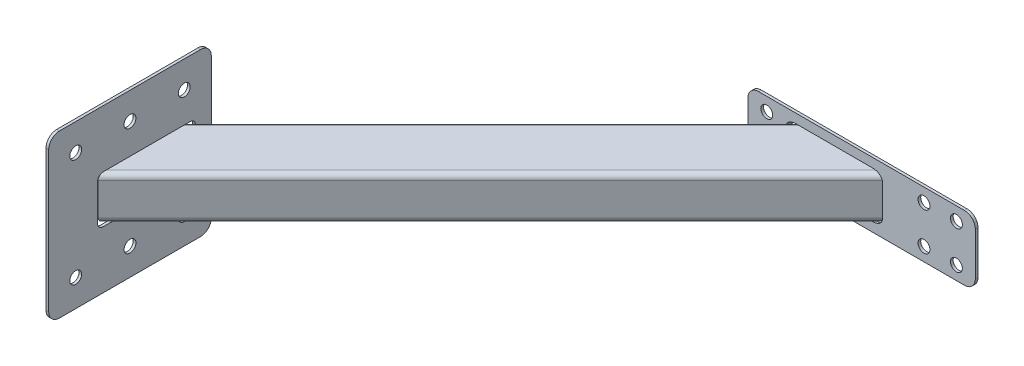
ISO-10303-21;
HEADER;
FILE_DESCRIPTION(('STEP AP214'),'2;1');
FILE_NAME('part.step','',(''),(''),'','','');
FILE_SCHEMA(('AUTOMOTIVE_DESIGN { 1 0 10303 214 1 1 1 1 }'));
ENDSEC;
DATA;
#1=APPLICATION_CONTEXT('core data for automotive mechanical design processes');
#2=APPLICATION_PROTOCOL_DEFINITION('international standard','automotive_design',2000,#1);
#3=PRODUCT_CONTEXT('',#1,'mechanical');
#4=PRODUCT('Part','Part','',(#3));
#5=PRODUCT_RELATED_PRODUCT_CATEGORY('part','',(#4));
#6=PRODUCT_DEFINITION_FORMATION('','',#4);
#7=PRODUCT_DEFINITION_CONTEXT('part definition',#1,'design');
#8=PRODUCT_DEFINITION('design','',#6,#7);
#9=PRODUCT_DEFINITION_SHAPE('','',#8);
#10=(LENGTH_UNIT() NAMED_UNIT(*) SI_UNIT(.MILLI.,.METRE.));
#11=(NAMED_UNIT(*) PLANE_ANGLE_UNIT() SI_UNIT($,.RADIAN.));
#12=(NAMED_UNIT(*) SI_UNIT($,.STERADIAN.) SOLID_ANGLE_UNIT());
#13=UNCERTAINTY_MEASURE_WITH_UNIT(LENGTH_MEASURE(1.E-05),#10,'distance_accuracy_value','');
#14=(GEOMETRIC_REPRESENTATION_CONTEXT(3) GLOBAL_UNCERTAINTY_ASSIGNED_CONTEXT((#13)) GLOBAL_UNIT_ASSIGNED_CONTEXT((#10,
#11,#12)) REPRESENTATION_CONTEXT('',''));
#15=CARTESIAN_POINT('',(0.,0.,0.));
#16=DIRECTION('',(0.,0.,1.));
#17=DIRECTION('',(1.,0.,0.));
#18=AXIS2_PLACEMENT_3D('',#15,#16,#17);
#19=CARTESIAN_POINT('',(8.89420183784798,150.,-191.416951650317));
#20=DIRECTION('',(0.,-1.,0.));
#21=DIRECTION('',(0.,0.,-1.));
#22=AXIS2_PLACEMENT_3D('',#19,#20,#21);
#23=PLANE('',#22);
#24=DIRECTION('',(0.,0.,-1.));
#25=VECTOR('',#24,1.);
#26=CARTESIAN_POINT('',(8.89420183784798,150.,-191.416951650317));
#27=LINE('',#26,#25);
#28=CARTESIAN_POINT('',(8.89420183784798,150.,-211.416951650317));
#29=VERTEX_POINT('',#28);
#30=CARTESIAN_POINT('',(8.89420183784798,150.,-472.33578257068));
#31=VERTEX_POINT('',#30);
#32=EDGE_CURVE('E264',#29,#31,#27,.T.);
#33=ORIENTED_EDGE('',*,*,#32,.F.);
#34=DIRECTION('',(-1.,0.,0.));
#35=VECTOR('',#34,1.);
#36=CARTESIAN_POINT('',(13.894201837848,150.,-211.416951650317));
#37=LINE('',#36,#35);
#38=CARTESIAN_POINT('',(13.894201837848,150.,-211.416951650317));
#39=VERTEX_POINT('',#38);
#40=EDGE_CURVE('E246',#29,#39,#37,.F.);
#41=ORIENTED_EDGE('',*,*,#40,.T.);
#42=DIRECTION('',(0.,0.,-1.));
#43=VECTOR('',#42,1.);
#44=CARTESIAN_POINT('',(13.894201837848,150.,-191.416951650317));
#45=LINE('',#44,#43);
#46=CARTESIAN_POINT('',(13.894201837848,150.,-472.33578257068));
#47=VERTEX_POINT('',#46);
#48=EDGE_CURVE('E271',#39,#47,#45,.T.);
#49=ORIENTED_EDGE('',*,*,#48,.T.);
#50=DIRECTION('',(-1.,0.,0.));
#51=VECTOR('',#50,1.);
#52=CARTESIAN_POINT('',(8.894201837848,150.,-472.33578257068));
#53=LINE('',#52,#51);
#54=EDGE_CURVE('E309',#47,#31,#53,.T.);
#55=ORIENTED_EDGE('',*,*,#54,.T.);
#56=EDGE_LOOP('',(#33,#41,#49,#55));
#57=FACE_BOUND('',#56,.T.);
#58=ADVANCED_FACE('F128',(#57),#23,.F.);
#59=CARTESIAN_POINT('',(8.89420183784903,-150.,-191.416951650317));
#60=DIRECTION('',(1.,0.,0.));
#61=DIRECTION('',(0.,1.,0.));
#62=AXIS2_PLACEMENT_3D('',#59,#60,#61);
#63=PLANE('',#62);
#64=DIRECTION('',(0.,0.,1.));
#65=VECTOR('',#64,1.);
#66=CARTESIAN_POINT('',(8.89420183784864,-43.9999999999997,-462.992636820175));
#67=LINE('',#66,#65);
#68=CARTESIAN_POINT('',(8.89420183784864,-43.9999999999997,-452.992636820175));
#69=VERTEX_POINT('',#68);
#70=CARTESIAN_POINT('',(8.89420183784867,-43.9999999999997,-291.973300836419));
#71=VERTEX_POINT('',#70);
#72=EDGE_CURVE('E379',#69,#71,#67,.T.);
#73=ORIENTED_EDGE('',*,*,#72,.F.);
#74=CARTESIAN_POINT('',(8.89420183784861,-33.9999999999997,-452.992636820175));
#75=DIRECTION('',(1.,0.,0.));
#76=DIRECTION('',(0.,1.,0.));
#77=AXIS2_PLACEMENT_3D('',#74,#75,#76);
#78=CIRCLE('',#77,10.);
#79=CARTESIAN_POINT('',(8.89420183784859,-33.9999999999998,-462.992636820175));
#80=VERTEX_POINT('',#79);
#81=EDGE_CURVE('E344',#69,#80,#78,.T.);
#82=ORIENTED_EDGE('',*,*,#81,.T.);
#83=DIRECTION('',(0.,-1.,0.));
#84=VECTOR('',#83,1.);
#85=CARTESIAN_POINT('',(8.89420183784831,43.9999999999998,-462.992636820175));
#86=LINE('',#85,#84);
#87=CARTESIAN_POINT('',(8.89420183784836,33.9999999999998,-462.992636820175));
#88=VERTEX_POINT('',#87);
#89=EDGE_CURVE('E354',#88,#80,#86,.T.);
#90=ORIENTED_EDGE('',*,*,#89,.F.);
#91=CARTESIAN_POINT('',(8.89420183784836,33.9999999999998,-452.992636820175));
#92=DIRECTION('',(1.,0.,0.));
#93=DIRECTION('',(0.,1.,0.));
#94=AXIS2_PLACEMENT_3D('',#91,#92,#93);
#95=CIRCLE('',#94,10.);
#96=CARTESIAN_POINT('',(8.89420183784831,43.9999999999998,-452.992636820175));
#97=VERTEX_POINT('',#96);
#98=EDGE_CURVE('E136',#88,#97,#95,.T.);
#99=ORIENTED_EDGE('',*,*,#98,.T.);
#100=DIRECTION('',(0.,0.,-1.));
#101=VECTOR('',#100,1.);
#102=CARTESIAN_POINT('',(8.89420183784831,43.9999999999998,-462.992636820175));
#103=LINE('',#102,#101);
#104=CARTESIAN_POINT('',(8.89420183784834,43.9999999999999,-291.973300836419));
#105=VERTEX_POINT('',#104);
#106=EDGE_CURVE('E353',#105,#97,#103,.T.);
#107=ORIENTED_EDGE('',*,*,#106,.F.);
#108=CARTESIAN_POINT('',(8.89420183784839,33.9999999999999,-291.973300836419));
#109=DIRECTION('',(1.,0.,0.));
#110=DIRECTION('',(0.,1.,0.));
#111=AXIS2_PLACEMENT_3D('',#108,#109,#110);
#112=CIRCLE('',#111,10.);
#113=CARTESIAN_POINT('',(8.89420183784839,33.9999999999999,-281.973300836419));
#114=VERTEX_POINT('',#113);
#115=EDGE_CURVE('E336',#105,#114,#112,.T.);
#116=ORIENTED_EDGE('',*,*,#115,.T.);
#117=DIRECTION('',(0.,1.,0.));
#118=VECTOR('',#117,1.);
#119=CARTESIAN_POINT('',(8.89420183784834,43.9999999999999,-281.973300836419));
#120=LINE('',#119,#118);
#121=CARTESIAN_POINT('',(8.89420183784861,-33.9999999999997,-281.973300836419));
#122=VERTEX_POINT('',#121);
#123=EDGE_CURVE('E363',#122,#114,#120,.T.);
#124=ORIENTED_EDGE('',*,*,#123,.F.);
#125=CARTESIAN_POINT('',(8.89420183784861,-33.9999999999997,-291.973300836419));
#126=DIRECTION('',(1.,0.,0.));
#127=DIRECTION('',(0.,1.,0.));
#128=AXIS2_PLACEMENT_3D('',#125,#126,#127);
#129=CIRCLE('',#128,10.);
#130=EDGE_CURVE('E340',#122,#71,#129,.T.);
#131=ORIENTED_EDGE('',*,*,#130,.T.);
#132=EDGE_LOOP('',(#73,#82,#90,#99,#107,#116,#124,#131));
#133=FACE_BOUND('',#132,.T.);
#134=CARTESIAN_POINT('',(8.89420183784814,99.9999999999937,-241.416951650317));
#135=DIRECTION('',(1.,0.,0.));
#136=DIRECTION('',(0.,1.,0.));
#137=AXIS2_PLACEMENT_3D('',#134,#135,#136);
#138=CIRCLE('',#137,10.9999999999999);
#139=CARTESIAN_POINT('',(8.8942018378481,110.999999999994,-241.416951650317));
#140=VERTEX_POINT('',#139);
#141=EDGE_CURVE('E277',#140,#140,#138,.T.);
#142=ORIENTED_EDGE('',*,*,#141,.T.);
#143=EDGE_LOOP('',(#142));
#144=FACE_BOUND('',#143,.T.);
#145=CARTESIAN_POINT('',(8.89420183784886,-100.000000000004,-341.876367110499));
#146=DIRECTION('',(1.,0.,0.));
#147=DIRECTION('',(0.,1.,0.));
#148=AXIS2_PLACEMENT_3D('',#145,#146,#147);
#149=CIRCLE('',#148,11.);
#150=CARTESIAN_POINT('',(8.89420183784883,-89.0000000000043,-341.876367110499));
#151=VERTEX_POINT('',#150);
#152=EDGE_CURVE('E412',#151,#151,#149,.T.);
#153=ORIENTED_EDGE('',*,*,#152,.T.);
#154=EDGE_LOOP('',(#153));
#155=FACE_BOUND('',#154,.T.);
#156=CARTESIAN_POINT('',(8.89420183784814,99.9999999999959,-341.876367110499));
#157=DIRECTION('',(1.,0.,0.));
#158=DIRECTION('',(0.,1.,0.));
#159=AXIS2_PLACEMENT_3D('',#156,#157,#158);
#160=CIRCLE('',#159,11.);
#161=CARTESIAN_POINT('',(8.8942018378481,110.999999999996,-341.876367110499));
#162=VERTEX_POINT('',#161);
#163=EDGE_CURVE('E410',#162,#162,#160,.T.);
#164=ORIENTED_EDGE('',*,*,#163,.T.);
#165=EDGE_LOOP('',(#164));
#166=FACE_BOUND('',#165,.T.);
#167=CARTESIAN_POINT('',(8.89420183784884,-100.000000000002,-442.335782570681));
#168=DIRECTION('',(1.,0.,0.));
#169=DIRECTION('',(0.,1.,0.));
#170=AXIS2_PLACEMENT_3D('',#167,#168,#169);
#171=CIRCLE('',#170,11.0000000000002);
#172=CARTESIAN_POINT('',(8.8942018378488,-89.0000000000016,-442.335782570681));
#173=VERTEX_POINT('',#172);
#174=EDGE_CURVE('E407',#173,#173,#171,.T.);
#175=ORIENTED_EDGE('',*,*,#174,.T.);
#176=EDGE_LOOP('',(#175));
#177=FACE_BOUND('',#176,.T.);
#178=CARTESIAN_POINT('',(8.89420183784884,-100.000000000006,-241.416951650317));
#179=DIRECTION('',(1.,0.,0.));
#180=DIRECTION('',(0.,1.,0.));
#181=AXIS2_PLACEMENT_3D('',#178,#179,#180);
#182=CIRCLE('',#181,10.9999999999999);
#183=CARTESIAN_POINT('',(8.8942018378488,-89.0000000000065,-241.416951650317));
#184=VERTEX_POINT('',#183);
#185=EDGE_CURVE('E404',#184,#184,#182,.T.);
#186=ORIENTED_EDGE('',*,*,#185,.T.);
#187=EDGE_LOOP('',(#186));
#188=FACE_BOUND('',#187,.T.);
#189=CARTESIAN_POINT('',(8.89420183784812,99.9999999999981,-442.335782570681));
#190=DIRECTION('',(1.,0.,0.));
#191=DIRECTION('',(0.,1.,0.));
#192=AXIS2_PLACEMENT_3D('',#189,#190,#191);
#193=CIRCLE('',#192,11.0000000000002);
#194=CARTESIAN_POINT('',(8.89420183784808,110.999999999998,-442.335782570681));
#195=VERTEX_POINT('',#194);
#196=EDGE_CURVE('E401',#195,#195,#193,.T.);
#197=ORIENTED_EDGE('',*,*,#196,.T.);
#198=EDGE_LOOP('',(#197));
#199=FACE_BOUND('',#198,.T.);
#200=DIRECTION('',(0.,0.,-1.));
#201=VECTOR('',#200,1.);
#202=CARTESIAN_POINT('',(8.89420183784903,-150.,-191.416951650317));
#203=LINE('',#202,#201);
#204=CARTESIAN_POINT('',(8.89420183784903,-150.,-211.416951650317));
#205=VERTEX_POINT('',#204);
#206=CARTESIAN_POINT('',(8.89420183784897,-150.,-472.33578257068));
#207=VERTEX_POINT('',#206);
#208=EDGE_CURVE('E287',#205,#207,#203,.T.);
#209=ORIENTED_EDGE('',*,*,#208,.F.);
#210=CARTESIAN_POINT('',(8.89420183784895,-130.,-211.416951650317));
#211=DIRECTION('',(1.,0.,0.));
#212=DIRECTION('',(0.,1.,0.));
#213=AXIS2_PLACEMENT_3D('',#210,#211,#212);
#214=CIRCLE('',#213,20.);
#215=CARTESIAN_POINT('',(8.89420183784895,-130.,-191.416951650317));
#216=VERTEX_POINT('',#215);
#217=EDGE_CURVE('E251',#205,#216,#214,.F.);
#218=ORIENTED_EDGE('',*,*,#217,.T.);
#219=DIRECTION('',(0.,-1.,0.));
#220=VECTOR('',#219,1.);
#221=CARTESIAN_POINT('',(8.89420183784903,-150.,-191.416951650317));
#222=LINE('',#221,#220);
#223=CARTESIAN_POINT('',(8.89420183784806,130.,-191.416951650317));
#224=VERTEX_POINT('',#223);
#225=EDGE_CURVE('E259',#224,#216,#222,.T.);
#226=ORIENTED_EDGE('',*,*,#225,.F.);
#227=CARTESIAN_POINT('',(8.89420183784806,130.,-211.416951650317));
#228=DIRECTION('',(1.,0.,0.));
#229=DIRECTION('',(0.,1.,0.));
#230=AXIS2_PLACEMENT_3D('',#227,#228,#229);
#231=CIRCLE('',#230,20.);
#232=EDGE_CURVE('E241',#224,#29,#231,.F.);
#233=ORIENTED_EDGE('',*,*,#232,.T.);
#234=ORIENTED_EDGE('',*,*,#32,.T.);
#235=CARTESIAN_POINT('',(8.89420183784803,130.,-472.33578257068));
#236=DIRECTION('',(1.,0.,0.));
#237=DIRECTION('',(0.,1.,0.));
#238=AXIS2_PLACEMENT_3D('',#235,#236,#237);
#239=CIRCLE('',#238,20.);
#240=CARTESIAN_POINT('',(8.89420183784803,130.,-492.335782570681));
#241=VERTEX_POINT('',#240);
#242=EDGE_CURVE('E305',#31,#241,#239,.F.);
#243=ORIENTED_EDGE('',*,*,#242,.T.);
#244=DIRECTION('',(0.,-1.,0.));
#245=VECTOR('',#244,1.);
#246=CARTESIAN_POINT('',(8.89420183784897,-150.,-492.335782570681));
#247=LINE('',#246,#245);
#248=CARTESIAN_POINT('',(8.89420183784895,-130.,-492.335782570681));
#249=VERTEX_POINT('',#248);
#250=EDGE_CURVE('E274',#241,#249,#247,.T.);
#251=ORIENTED_EDGE('',*,*,#250,.T.);
#252=CARTESIAN_POINT('',(8.89420183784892,-130.,-472.33578257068));
#253=DIRECTION('',(1.,0.,0.));
#254=DIRECTION('',(0.,1.,0.));
#255=AXIS2_PLACEMENT_3D('',#252,#253,#254);
#256=CIRCLE('',#255,20.);
#257=EDGE_CURVE('E252',#249,#207,#256,.F.);
#258=ORIENTED_EDGE('',*,*,#257,.T.);
#259=EDGE_LOOP('',(#209,#218,#226,#233,#234,#243,#251,#258));
#260=FACE_BOUND('',#259,.T.);
#261=ADVANCED_FACE('F267',(#133,#144,#155,#166,#177,#188,#199,#260),#63,.F.);
#262=CARTESIAN_POINT('',(8.89420183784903,-150.,-191.416951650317));
#263=DIRECTION('',(0.,1.,0.));
#264=DIRECTION('',(0.,0.,1.));
#265=AXIS2_PLACEMENT_3D('',#262,#263,#264);
#266=PLANE('',#265);
#267=DIRECTION('',(0.,0.,-1.));
#268=VECTOR('',#267,1.);
#269=CARTESIAN_POINT('',(13.894201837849,-150.,-191.416951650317));
#270=LINE('',#269,#268);
#271=CARTESIAN_POINT('',(13.894201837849,-150.,-211.416951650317));
#272=VERTEX_POINT('',#271);
#273=CARTESIAN_POINT('',(13.894201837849,-150.,-472.33578257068));
#274=VERTEX_POINT('',#273);
#275=EDGE_CURVE('E284',#272,#274,#270,.T.);
#276=ORIENTED_EDGE('',*,*,#275,.F.);
#277=DIRECTION('',(1.,0.,0.));
#278=VECTOR('',#277,1.);
#279=CARTESIAN_POINT('',(8.89420183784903,-150.,-211.416951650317));
#280=LINE('',#279,#278);
#281=EDGE_CURVE('E303',#272,#205,#280,.F.);
#282=ORIENTED_EDGE('',*,*,#281,.T.);
#283=ORIENTED_EDGE('',*,*,#208,.T.);
#284=DIRECTION('',(1.,0.,0.));
#285=VECTOR('',#284,1.);
#286=CARTESIAN_POINT('',(8.89420183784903,-150.,-472.33578257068));
#287=LINE('',#286,#285);
#288=EDGE_CURVE('E300',#207,#274,#287,.T.);
#289=ORIENTED_EDGE('',*,*,#288,.T.);
#290=EDGE_LOOP('',(#276,#282,#283,#289));
#291=FACE_BOUND('',#290,.T.);
#292=ADVANCED_FACE('F439',(#291),#266,.F.);
#293=CARTESIAN_POINT('',(13.894201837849,-150.,-191.416951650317));
#294=DIRECTION('',(-1.,0.,0.));
#295=DIRECTION('',(0.,-1.,0.));
#296=AXIS2_PLACEMENT_3D('',#293,#294,#295);
#297=PLANE('',#296);
#298=DIRECTION('',(0.,1.,0.));
#299=VECTOR('',#298,1.);
#300=CARTESIAN_POINT('',(13.8942018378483,43.9999999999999,-281.973300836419));
#301=LINE('',#300,#299);
#302=CARTESIAN_POINT('',(13.8942018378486,-33.9999999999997,-281.973300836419));
#303=VERTEX_POINT('',#302);
#304=CARTESIAN_POINT('',(13.8942018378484,33.9999999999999,-281.973300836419));
#305=VERTEX_POINT('',#304);
#306=EDGE_CURVE('E370',#303,#305,#301,.T.);
#307=ORIENTED_EDGE('',*,*,#306,.T.);
#308=CARTESIAN_POINT('',(13.8942018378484,33.9999999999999,-291.973300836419));
#309=DIRECTION('',(-1.,0.,0.));
#310=DIRECTION('',(0.,-1.,0.));
#311=AXIS2_PLACEMENT_3D('',#308,#309,#310);
#312=CIRCLE('',#311,10.);
#313=CARTESIAN_POINT('',(13.8942018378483,43.9999999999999,-291.973300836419));
#314=VERTEX_POINT('',#313);
#315=EDGE_CURVE('E338',#305,#314,#312,.T.);
#316=ORIENTED_EDGE('',*,*,#315,.T.);
#317=DIRECTION('',(0.,0.,-1.));
#318=VECTOR('',#317,1.);
#319=CARTESIAN_POINT('',(13.8942018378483,43.9999999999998,-462.992636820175));
#320=LINE('',#319,#318);
#321=CARTESIAN_POINT('',(13.8942018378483,43.9999999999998,-452.992636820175));
#322=VERTEX_POINT('',#321);
#323=EDGE_CURVE('E375',#314,#322,#320,.T.);
#324=ORIENTED_EDGE('',*,*,#323,.T.);
#325=CARTESIAN_POINT('',(13.8942018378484,33.9999999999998,-452.992636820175));
#326=DIRECTION('',(-1.,0.,0.));
#327=DIRECTION('',(0.,-1.,0.));
#328=AXIS2_PLACEMENT_3D('',#325,#326,#327);
#329=CIRCLE('',#328,10.);
#330=CARTESIAN_POINT('',(13.8942018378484,33.9999999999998,-462.992636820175));
#331=VERTEX_POINT('',#330);
#332=EDGE_CURVE('E14',#322,#331,#329,.T.);
#333=ORIENTED_EDGE('',*,*,#332,.T.);
#334=DIRECTION('',(0.,-1.,0.));
#335=VECTOR('',#334,1.);
#336=CARTESIAN_POINT('',(13.8942018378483,43.9999999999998,-462.992636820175));
#337=LINE('',#336,#335);
#338=CARTESIAN_POINT('',(13.8942018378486,-33.9999999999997,-462.992636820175));
#339=VERTEX_POINT('',#338);
#340=EDGE_CURVE('E362',#331,#339,#337,.T.);
#341=ORIENTED_EDGE('',*,*,#340,.T.);
#342=CARTESIAN_POINT('',(13.8942018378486,-33.9999999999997,-452.992636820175));
#343=DIRECTION('',(-1.,0.,0.));
#344=DIRECTION('',(0.,-1.,0.));
#345=AXIS2_PLACEMENT_3D('',#342,#343,#344);
#346=CIRCLE('',#345,10.);
#347=CARTESIAN_POINT('',(13.8942018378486,-43.9999999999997,-452.992636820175));
#348=VERTEX_POINT('',#347);
#349=EDGE_CURVE('E346',#339,#348,#346,.T.);
#350=ORIENTED_EDGE('',*,*,#349,.T.);
#351=DIRECTION('',(0.,0.,1.));
#352=VECTOR('',#351,1.);
#353=CARTESIAN_POINT('',(13.8942018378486,-43.9999999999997,-462.992636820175));
#354=LINE('',#353,#352);
#355=CARTESIAN_POINT('',(13.8942018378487,-43.9999999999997,-291.973300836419));
#356=VERTEX_POINT('',#355);
#357=EDGE_CURVE('E367',#348,#356,#354,.T.);
#358=ORIENTED_EDGE('',*,*,#357,.T.);
#359=CARTESIAN_POINT('',(13.8942018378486,-33.9999999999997,-291.973300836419));
#360=DIRECTION('',(-1.,0.,0.));
#361=DIRECTION('',(0.,-1.,0.));
#362=AXIS2_PLACEMENT_3D('',#359,#360,#361);
#363=CIRCLE('',#362,10.);
#364=EDGE_CURVE('E342',#356,#303,#363,.T.);
#365=ORIENTED_EDGE('',*,*,#364,.T.);
#366=EDGE_LOOP('',(#307,#316,#324,#333,#341,#350,#358,#365));
#367=FACE_BOUND('',#366,.T.);
#368=CARTESIAN_POINT('',(13.8942018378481,99.9999999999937,-241.416951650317));
#369=DIRECTION('',(1.,0.,0.));
#370=DIRECTION('',(0.,1.,0.));
#371=AXIS2_PLACEMENT_3D('',#368,#369,#370);
#372=CIRCLE('',#371,10.9999999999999);
#373=CARTESIAN_POINT('',(13.8942018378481,110.999999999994,-241.416951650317));
#374=VERTEX_POINT('',#373);
#375=EDGE_CURVE('E386',#374,#374,#372,.T.);
#376=ORIENTED_EDGE('',*,*,#375,.F.);
#377=EDGE_LOOP('',(#376));
#378=FACE_BOUND('',#377,.T.);
#379=CARTESIAN_POINT('',(13.8942018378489,-100.000000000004,-341.876367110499));
#380=DIRECTION('',(1.,0.,0.));
#381=DIRECTION('',(0.,1.,0.));
#382=AXIS2_PLACEMENT_3D('',#379,#380,#381);
#383=CIRCLE('',#382,11.);
#384=CARTESIAN_POINT('',(13.8942018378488,-89.0000000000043,-341.876367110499));
#385=VERTEX_POINT('',#384);
#386=EDGE_CURVE('E387',#385,#385,#383,.T.);
#387=ORIENTED_EDGE('',*,*,#386,.F.);
#388=EDGE_LOOP('',(#387));
#389=FACE_BOUND('',#388,.T.);
#390=CARTESIAN_POINT('',(13.8942018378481,99.9999999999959,-341.876367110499));
#391=DIRECTION('',(1.,0.,0.));
#392=DIRECTION('',(0.,1.,0.));
#393=AXIS2_PLACEMENT_3D('',#390,#391,#392);
#394=CIRCLE('',#393,11.);
#395=CARTESIAN_POINT('',(13.8942018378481,110.999999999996,-341.876367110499));
#396=VERTEX_POINT('',#395);
#397=EDGE_CURVE('E390',#396,#396,#394,.T.);
#398=ORIENTED_EDGE('',*,*,#397,.F.);
#399=EDGE_LOOP('',(#398));
#400=FACE_BOUND('',#399,.T.);
#401=CARTESIAN_POINT('',(13.8942018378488,-100.000000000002,-442.335782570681));
#402=DIRECTION('',(1.,0.,0.));
#403=DIRECTION('',(0.,1.,0.));
#404=AXIS2_PLACEMENT_3D('',#401,#402,#403);
#405=CIRCLE('',#404,11.0000000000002);
#406=CARTESIAN_POINT('',(13.8942018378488,-89.0000000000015,-442.335782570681));
#407=VERTEX_POINT('',#406);
#408=EDGE_CURVE('E393',#407,#407,#405,.T.);
#409=ORIENTED_EDGE('',*,*,#408,.F.);
#410=EDGE_LOOP('',(#409));
#411=FACE_BOUND('',#410,.T.);
#412=CARTESIAN_POINT('',(13.8942018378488,-100.000000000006,-241.416951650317));
#413=DIRECTION('',(1.,0.,0.));
#414=DIRECTION('',(0.,1.,0.));
#415=AXIS2_PLACEMENT_3D('',#412,#413,#414);
#416=CIRCLE('',#415,10.9999999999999);
#417=CARTESIAN_POINT('',(13.8942018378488,-89.0000000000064,-241.416951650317));
#418=VERTEX_POINT('',#417);
#419=EDGE_CURVE('E377',#418,#418,#416,.T.);
#420=ORIENTED_EDGE('',*,*,#419,.F.);
#421=EDGE_LOOP('',(#420));
#422=FACE_BOUND('',#421,.T.);
#423=CARTESIAN_POINT('',(13.8942018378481,99.9999999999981,-442.335782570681));
#424=DIRECTION('',(1.,0.,0.));
#425=DIRECTION('',(0.,1.,0.));
#426=AXIS2_PLACEMENT_3D('',#423,#424,#425);
#427=CIRCLE('',#426,11.0000000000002);
#428=CARTESIAN_POINT('',(13.8942018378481,110.999999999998,-442.335782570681));
#429=VERTEX_POINT('',#428);
#430=EDGE_CURVE('E396',#429,#429,#427,.T.);
#431=ORIENTED_EDGE('',*,*,#430,.F.);
#432=EDGE_LOOP('',(#431));
#433=FACE_BOUND('',#432,.T.);
#434=DIRECTION('',(0.,1.,0.));
#435=VECTOR('',#434,1.);
#436=CARTESIAN_POINT('',(13.894201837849,-150.,-191.416951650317));
#437=LINE('',#436,#435);
#438=CARTESIAN_POINT('',(13.894201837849,-130.,-191.416951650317));
#439=VERTEX_POINT('',#438);
#440=CARTESIAN_POINT('',(13.8942018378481,130.,-191.416951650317));
#441=VERTEX_POINT('',#440);
#442=EDGE_CURVE('E262',#439,#441,#437,.T.);
#443=ORIENTED_EDGE('',*,*,#442,.F.);
#444=CARTESIAN_POINT('',(13.894201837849,-130.,-211.416951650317));
#445=DIRECTION('',(-1.,0.,0.));
#446=DIRECTION('',(0.,-1.,0.));
#447=AXIS2_PLACEMENT_3D('',#444,#445,#446);
#448=CIRCLE('',#447,20.);
#449=EDGE_CURVE('E298',#439,#272,#448,.F.);
#450=ORIENTED_EDGE('',*,*,#449,.T.);
#451=ORIENTED_EDGE('',*,*,#275,.T.);
#452=CARTESIAN_POINT('',(13.8942018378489,-130.,-472.33578257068));
#453=DIRECTION('',(-1.,0.,0.));
#454=DIRECTION('',(0.,-1.,0.));
#455=AXIS2_PLACEMENT_3D('',#452,#453,#454);
#456=CIRCLE('',#455,20.);
#457=CARTESIAN_POINT('',(13.8942018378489,-130.,-492.335782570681));
#458=VERTEX_POINT('',#457);
#459=EDGE_CURVE('E294',#274,#458,#456,.F.);
#460=ORIENTED_EDGE('',*,*,#459,.T.);
#461=DIRECTION('',(0.,1.,0.));
#462=VECTOR('',#461,1.);
#463=CARTESIAN_POINT('',(13.894201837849,-150.,-492.335782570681));
#464=LINE('',#463,#462);
#465=CARTESIAN_POINT('',(13.894201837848,130.,-492.335782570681));
#466=VERTEX_POINT('',#465);
#467=EDGE_CURVE('E269',#458,#466,#464,.T.);
#468=ORIENTED_EDGE('',*,*,#467,.T.);
#469=CARTESIAN_POINT('',(13.894201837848,130.,-472.33578257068));
#470=DIRECTION('',(-1.,0.,0.));
#471=DIRECTION('',(0.,-1.,0.));
#472=AXIS2_PLACEMENT_3D('',#469,#470,#471);
#473=CIRCLE('',#472,20.);
#474=EDGE_CURVE('E292',#466,#47,#473,.F.);
#475=ORIENTED_EDGE('',*,*,#474,.T.);
#476=ORIENTED_EDGE('',*,*,#48,.F.);
#477=CARTESIAN_POINT('',(13.8942018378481,130.,-211.416951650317));
#478=DIRECTION('',(-1.,0.,0.));
#479=DIRECTION('',(0.,-1.,0.));
#480=AXIS2_PLACEMENT_3D('',#477,#478,#479);
#481=CIRCLE('',#480,20.);
#482=EDGE_CURVE('E296',#39,#441,#481,.F.);
#483=ORIENTED_EDGE('',*,*,#482,.T.);
#484=EDGE_LOOP('',(#443,#450,#451,#460,#468,#475,#476,#483));
#485=FACE_BOUND('',#484,.T.);
#486=ADVANCED_FACE('F475',(#367,#378,#389,#400,#411,#422,#433,#485),#297,.F.);
#487=CARTESIAN_POINT('',(0.,0.,-191.416951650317));
#488=DIRECTION('',(0.,0.,1.));
#489=DIRECTION('',(1.,0.,0.));
#490=AXIS2_PLACEMENT_3D('',#487,#488,#489);
#491=PLANE('',#490);
#492=ORIENTED_EDGE('',*,*,#225,.T.);
#493=DIRECTION('',(1.,0.,0.));
#494=VECTOR('',#493,1.);
#495=CARTESIAN_POINT('',(13.894201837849,-130.,-191.416951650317));
#496=LINE('',#495,#494);
#497=EDGE_CURVE('E263',#216,#439,#496,.T.);
#498=ORIENTED_EDGE('',*,*,#497,.T.);
#499=ORIENTED_EDGE('',*,*,#442,.T.);
#500=DIRECTION('',(-1.,0.,0.));
#501=VECTOR('',#500,1.);
#502=CARTESIAN_POINT('',(8.894201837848,130.,-191.416951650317));
#503=LINE('',#502,#501);
#504=EDGE_CURVE('E245',#441,#224,#503,.T.);
#505=ORIENTED_EDGE('',*,*,#504,.T.);
#506=EDGE_LOOP('',(#492,#498,#499,#505));
#507=FACE_BOUND('',#506,.T.);
#508=ADVANCED_FACE('F257',(#507),#491,.T.);
#509=CARTESIAN_POINT('',(0.,0.,-492.335782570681));
#510=DIRECTION('',(0.,0.,1.));
#511=DIRECTION('',(1.,0.,0.));
#512=AXIS2_PLACEMENT_3D('',#509,#510,#511);
#513=PLANE('',#512);
#514=ORIENTED_EDGE('',*,*,#467,.F.);
#515=DIRECTION('',(1.,0.,0.));
#516=VECTOR('',#515,1.);
#517=CARTESIAN_POINT('',(0.,-130.,-492.335782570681));
#518=LINE('',#517,#516);
#519=EDGE_CURVE('E315',#458,#249,#518,.F.);
#520=ORIENTED_EDGE('',*,*,#519,.T.);
#521=ORIENTED_EDGE('',*,*,#250,.F.);
#522=DIRECTION('',(-1.,0.,0.));
#523=VECTOR('',#522,1.);
#524=CARTESIAN_POINT('',(0.,130.,-492.335782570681));
#525=LINE('',#524,#523);
#526=EDGE_CURVE('E313',#241,#466,#525,.F.);
#527=ORIENTED_EDGE('',*,*,#526,.T.);
#528=EDGE_LOOP('',(#514,#520,#521,#527));
#529=FACE_BOUND('',#528,.T.);
#530=ADVANCED_FACE('F446',(#529),#513,.F.);
#531=CARTESIAN_POINT('',(0.,-130.,-211.416951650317));
#532=DIRECTION('',(-1.,0.,0.));
#533=DIRECTION('',(0.,0.,1.));
#534=AXIS2_PLACEMENT_3D('',#531,#532,#533);
#535=CYLINDRICAL_SURFACE('',#534,20.);
#536=ORIENTED_EDGE('',*,*,#217,.F.);
#537=ORIENTED_EDGE('',*,*,#281,.F.);
#538=ORIENTED_EDGE('',*,*,#449,.F.);
#539=ORIENTED_EDGE('',*,*,#497,.F.);
#540=EDGE_LOOP('',(#536,#537,#538,#539));
#541=FACE_BOUND('',#540,.T.);
#542=ADVANCED_FACE('F443',(#541),#535,.T.);
#543=CARTESIAN_POINT('',(0.,130.,-211.416951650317));
#544=DIRECTION('',(1.,0.,0.));
#545=DIRECTION('',(0.,0.,-1.));
#546=AXIS2_PLACEMENT_3D('',#543,#544,#545);
#547=CYLINDRICAL_SURFACE('',#546,20.);
#548=ORIENTED_EDGE('',*,*,#482,.F.);
#549=ORIENTED_EDGE('',*,*,#40,.F.);
#550=ORIENTED_EDGE('',*,*,#232,.F.);
#551=ORIENTED_EDGE('',*,*,#504,.F.);
#552=EDGE_LOOP('',(#548,#549,#550,#551));
#553=FACE_BOUND('',#552,.T.);
#554=ADVANCED_FACE('F244',(#553),#547,.T.);
#555=CARTESIAN_POINT('',(8.89420183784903,-130.,-472.33578257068));
#556=DIRECTION('',(1.,0.,0.));
#557=DIRECTION('',(0.,0.,-1.));
#558=AXIS2_PLACEMENT_3D('',#555,#556,#557);
#559=CYLINDRICAL_SURFACE('',#558,20.);
#560=ORIENTED_EDGE('',*,*,#257,.F.);
#561=ORIENTED_EDGE('',*,*,#519,.F.);
#562=ORIENTED_EDGE('',*,*,#459,.F.);
#563=ORIENTED_EDGE('',*,*,#288,.F.);
#564=EDGE_LOOP('',(#560,#561,#562,#563));
#565=FACE_BOUND('',#564,.T.);
#566=ADVANCED_FACE('F450',(#565),#559,.T.);
#567=CARTESIAN_POINT('',(8.89420183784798,130.,-472.33578257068));
#568=DIRECTION('',(-1.,0.,0.));
#569=DIRECTION('',(0.,0.,1.));
#570=AXIS2_PLACEMENT_3D('',#567,#568,#569);
#571=CYLINDRICAL_SURFACE('',#570,20.);
#572=ORIENTED_EDGE('',*,*,#474,.F.);
#573=ORIENTED_EDGE('',*,*,#526,.F.);
#574=ORIENTED_EDGE('',*,*,#242,.F.);
#575=ORIENTED_EDGE('',*,*,#54,.F.);
#576=EDGE_LOOP('',(#572,#573,#574,#575));
#577=FACE_BOUND('',#576,.T.);
#578=ADVANCED_FACE('F453',(#577),#571,.T.);
#579=CARTESIAN_POINT('',(3.89420183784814,99.9999999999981,-442.335782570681));
#580=DIRECTION('',(1.,0.,0.));
#581=DIRECTION('',(0.,1.,0.));
#582=AXIS2_PLACEMENT_3D('',#579,#580,#581);
#583=CYLINDRICAL_SURFACE('',#582,11.0000000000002);
#584=ORIENTED_EDGE('',*,*,#430,.T.);
#585=EDGE_LOOP('',(#584));
#586=FACE_BOUND('',#585,.T.);
#587=ORIENTED_EDGE('',*,*,#196,.F.);
#588=EDGE_LOOP('',(#587));
#589=FACE_BOUND('',#588,.T.);
#590=ADVANCED_FACE('F457',(#586,#589),#583,.F.);
#591=CARTESIAN_POINT('',(3.89420183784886,-100.000000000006,-241.416951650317));
#592=DIRECTION('',(1.,0.,0.));
#593=DIRECTION('',(0.,1.,0.));
#594=AXIS2_PLACEMENT_3D('',#591,#592,#593);
#595=CYLINDRICAL_SURFACE('',#594,10.9999999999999);
#596=ORIENTED_EDGE('',*,*,#419,.T.);
#597=EDGE_LOOP('',(#596));
#598=FACE_BOUND('',#597,.T.);
#599=ORIENTED_EDGE('',*,*,#185,.F.);
#600=EDGE_LOOP('',(#599));
#601=FACE_BOUND('',#600,.T.);
#602=ADVANCED_FACE('F496',(#598,#601),#595,.F.);
#603=CARTESIAN_POINT('',(3.89420183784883,-100.000000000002,-442.335782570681));
#604=DIRECTION('',(1.,0.,0.));
#605=DIRECTION('',(0.,1.,0.));
#606=AXIS2_PLACEMENT_3D('',#603,#604,#605);
#607=CYLINDRICAL_SURFACE('',#606,11.0000000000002);
#608=ORIENTED_EDGE('',*,*,#408,.T.);
#609=EDGE_LOOP('',(#608));
#610=FACE_BOUND('',#609,.T.);
#611=ORIENTED_EDGE('',*,*,#174,.F.);
#612=EDGE_LOOP('',(#611));
#613=FACE_BOUND('',#612,.T.);
#614=ADVANCED_FACE('F498',(#610,#613),#607,.F.);
#615=CARTESIAN_POINT('',(3.89420183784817,99.9999999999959,-341.876367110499));
#616=DIRECTION('',(1.,0.,0.));
#617=DIRECTION('',(0.,1.,0.));
#618=AXIS2_PLACEMENT_3D('',#615,#616,#617);
#619=CYLINDRICAL_SURFACE('',#618,11.);
#620=ORIENTED_EDGE('',*,*,#397,.T.);
#621=EDGE_LOOP('',(#620));
#622=FACE_BOUND('',#621,.T.);
#623=ORIENTED_EDGE('',*,*,#163,.F.);
#624=EDGE_LOOP('',(#623));
#625=FACE_BOUND('',#624,.T.);
#626=ADVANCED_FACE('F429',(#622,#625),#619,.F.);
#627=CARTESIAN_POINT('',(3.89420183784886,-100.000000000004,-341.876367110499));
#628=DIRECTION('',(1.,0.,0.));
#629=DIRECTION('',(0.,1.,0.));
#630=AXIS2_PLACEMENT_3D('',#627,#628,#629);
#631=CYLINDRICAL_SURFACE('',#630,11.);
#632=ORIENTED_EDGE('',*,*,#386,.T.);
#633=EDGE_LOOP('',(#632));
#634=FACE_BOUND('',#633,.T.);
#635=ORIENTED_EDGE('',*,*,#152,.F.);
#636=EDGE_LOOP('',(#635));
#637=FACE_BOUND('',#636,.T.);
#638=ADVANCED_FACE('F421',(#634,#637),#631,.F.);
#639=CARTESIAN_POINT('',(3.89420183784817,99.9999999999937,-241.416951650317));
#640=DIRECTION('',(1.,0.,0.));
#641=DIRECTION('',(0.,1.,0.));
#642=AXIS2_PLACEMENT_3D('',#639,#640,#641);
#643=CYLINDRICAL_SURFACE('',#642,10.9999999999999);
#644=ORIENTED_EDGE('',*,*,#375,.T.);
#645=EDGE_LOOP('',(#644));
#646=FACE_BOUND('',#645,.T.);
#647=ORIENTED_EDGE('',*,*,#141,.F.);
#648=EDGE_LOOP('',(#647));
#649=FACE_BOUND('',#648,.T.);
#650=ADVANCED_FACE('F419',(#646,#649),#643,.F.);
#651=CARTESIAN_POINT('',(13.8942018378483,43.9999999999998,-462.992636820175));
#652=DIRECTION('',(0.,0.,-1.));
#653=DIRECTION('',(-1.,0.,0.));
#654=AXIS2_PLACEMENT_3D('',#651,#652,#653);
#655=PLANE('',#654);
#656=ORIENTED_EDGE('',*,*,#89,.T.);
#657=DIRECTION('',(-1.,0.,0.));
#658=VECTOR('',#657,1.);
#659=CARTESIAN_POINT('',(13.8942018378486,-33.9999999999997,-462.992636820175));
#660=LINE('',#659,#658);
#661=EDGE_CURVE('E143',#80,#339,#660,.F.);
#662=ORIENTED_EDGE('',*,*,#661,.T.);
#663=ORIENTED_EDGE('',*,*,#340,.F.);
#664=DIRECTION('',(-1.,0.,0.));
#665=VECTOR('',#664,1.);
#666=CARTESIAN_POINT('',(8.89420183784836,33.9999999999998,-462.992636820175));
#667=LINE('',#666,#665);
#668=EDGE_CURVE('E332',#331,#88,#667,.T.);
#669=ORIENTED_EDGE('',*,*,#668,.T.);
#670=EDGE_LOOP('',(#656,#662,#663,#669));
#671=FACE_BOUND('',#670,.T.);
#672=ADVANCED_FACE('F365',(#671),#655,.F.);
#673=CARTESIAN_POINT('',(13.8942018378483,43.9999999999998,-462.992636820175));
#674=DIRECTION('',(0.,1.,0.));
#675=DIRECTION('',(-1.,0.,0.));
#676=AXIS2_PLACEMENT_3D('',#673,#674,#675);
#677=PLANE('',#676);
#678=ORIENTED_EDGE('',*,*,#323,.F.);
#679=DIRECTION('',(-1.,0.,0.));
#680=VECTOR('',#679,1.);
#681=CARTESIAN_POINT('',(8.89420183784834,43.9999999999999,-291.973300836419));
#682=LINE('',#681,#680);
#683=EDGE_CURVE('E319',#314,#105,#682,.T.);
#684=ORIENTED_EDGE('',*,*,#683,.T.);
#685=ORIENTED_EDGE('',*,*,#106,.T.);
#686=DIRECTION('',(-1.,0.,0.));
#687=VECTOR('',#686,1.);
#688=CARTESIAN_POINT('',(13.8942018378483,43.9999999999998,-452.992636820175));
#689=LINE('',#688,#687);
#690=EDGE_CURVE('E317',#97,#322,#689,.F.);
#691=ORIENTED_EDGE('',*,*,#690,.T.);
#692=EDGE_LOOP('',(#678,#684,#685,#691));
#693=FACE_BOUND('',#692,.T.);
#694=ADVANCED_FACE('F360',(#693),#677,.F.);
#695=CARTESIAN_POINT('',(13.8942018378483,43.9999999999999,-281.973300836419));
#696=DIRECTION('',(0.,0.,1.));
#697=DIRECTION('',(1.,0.,0.));
#698=AXIS2_PLACEMENT_3D('',#695,#696,#697);
#699=PLANE('',#698);
#700=ORIENTED_EDGE('',*,*,#123,.T.);
#701=DIRECTION('',(-1.,0.,0.));
#702=VECTOR('',#701,1.);
#703=CARTESIAN_POINT('',(13.8942018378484,33.9999999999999,-281.973300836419));
#704=LINE('',#703,#702);
#705=EDGE_CURVE('E325',#114,#305,#704,.F.);
#706=ORIENTED_EDGE('',*,*,#705,.T.);
#707=ORIENTED_EDGE('',*,*,#306,.F.);
#708=DIRECTION('',(-1.,0.,0.));
#709=VECTOR('',#708,1.);
#710=CARTESIAN_POINT('',(8.89420183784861,-33.9999999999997,-281.973300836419));
#711=LINE('',#710,#709);
#712=EDGE_CURVE('E322',#303,#122,#711,.T.);
#713=ORIENTED_EDGE('',*,*,#712,.T.);
#714=EDGE_LOOP('',(#700,#706,#707,#713));
#715=FACE_BOUND('',#714,.T.);
#716=ADVANCED_FACE('F484',(#715),#699,.F.);
#717=CARTESIAN_POINT('',(13.8942018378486,-43.9999999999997,-462.992636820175));
#718=DIRECTION('',(0.,-1.,0.));
#719=DIRECTION('',(1.,0.,0.));
#720=AXIS2_PLACEMENT_3D('',#717,#718,#719);
#721=PLANE('',#720);
#722=ORIENTED_EDGE('',*,*,#72,.T.);
#723=DIRECTION('',(-1.,0.,0.));
#724=VECTOR('',#723,1.);
#725=CARTESIAN_POINT('',(13.8942018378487,-43.9999999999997,-291.973300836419));
#726=LINE('',#725,#724);
#727=EDGE_CURVE('E330',#71,#356,#726,.F.);
#728=ORIENTED_EDGE('',*,*,#727,.T.);
#729=ORIENTED_EDGE('',*,*,#357,.F.);
#730=DIRECTION('',(-1.,0.,0.));
#731=VECTOR('',#730,1.);
#732=CARTESIAN_POINT('',(8.89420183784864,-43.9999999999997,-452.992636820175));
#733=LINE('',#732,#731);
#734=EDGE_CURVE('E327',#348,#69,#733,.T.);
#735=ORIENTED_EDGE('',*,*,#734,.T.);
#736=EDGE_LOOP('',(#722,#728,#729,#735));
#737=FACE_BOUND('',#736,.T.);
#738=ADVANCED_FACE('F463',(#737),#721,.F.);
#739=CARTESIAN_POINT('',(13.8942018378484,33.9999999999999,-291.973300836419));
#740=DIRECTION('',(1.,0.,0.));
#741=DIRECTION('',(0.,1.,0.));
#742=AXIS2_PLACEMENT_3D('',#739,#740,#741);
#743=CYLINDRICAL_SURFACE('',#742,10.);
#744=ORIENTED_EDGE('',*,*,#315,.F.);
#745=ORIENTED_EDGE('',*,*,#705,.F.);
#746=ORIENTED_EDGE('',*,*,#115,.F.);
#747=ORIENTED_EDGE('',*,*,#683,.F.);
#748=EDGE_LOOP('',(#744,#745,#746,#747));
#749=FACE_BOUND('',#748,.T.);
#750=ADVANCED_FACE('F459',(#749),#743,.F.);
#751=CARTESIAN_POINT('',(13.8942018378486,-33.9999999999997,-291.973300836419));
#752=DIRECTION('',(1.,0.,0.));
#753=DIRECTION('',(0.,1.,0.));
#754=AXIS2_PLACEMENT_3D('',#751,#752,#753);
#755=CYLINDRICAL_SURFACE('',#754,10.);
#756=ORIENTED_EDGE('',*,*,#364,.F.);
#757=ORIENTED_EDGE('',*,*,#727,.F.);
#758=ORIENTED_EDGE('',*,*,#130,.F.);
#759=ORIENTED_EDGE('',*,*,#712,.F.);
#760=EDGE_LOOP('',(#756,#757,#758,#759));
#761=FACE_BOUND('',#760,.T.);
#762=ADVANCED_FACE('F462',(#761),#755,.F.);
#763=CARTESIAN_POINT('',(13.8942018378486,-33.9999999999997,-452.992636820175));
#764=DIRECTION('',(1.,0.,0.));
#765=DIRECTION('',(0.,1.,0.));
#766=AXIS2_PLACEMENT_3D('',#763,#764,#765);
#767=CYLINDRICAL_SURFACE('',#766,10.);
#768=ORIENTED_EDGE('',*,*,#349,.F.);
#769=ORIENTED_EDGE('',*,*,#661,.F.);
#770=ORIENTED_EDGE('',*,*,#81,.F.);
#771=ORIENTED_EDGE('',*,*,#734,.F.);
#772=EDGE_LOOP('',(#768,#769,#770,#771));
#773=FACE_BOUND('',#772,.T.);
#774=ADVANCED_FACE('F466',(#773),#767,.F.);
#775=CARTESIAN_POINT('',(13.8942018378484,33.9999999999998,-452.992636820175));
#776=DIRECTION('',(1.,0.,0.));
#777=DIRECTION('',(0.,1.,0.));
#778=AXIS2_PLACEMENT_3D('',#775,#776,#777);
#779=CYLINDRICAL_SURFACE('',#778,10.);
#780=ORIENTED_EDGE('',*,*,#332,.F.);
#781=ORIENTED_EDGE('',*,*,#690,.F.);
#782=ORIENTED_EDGE('',*,*,#98,.F.);
#783=ORIENTED_EDGE('',*,*,#668,.F.);
#784=EDGE_LOOP('',(#780,#781,#782,#783));
#785=FACE_BOUND('',#784,.T.);
#786=ADVANCED_FACE('F130',(#785),#779,.F.);
#787=CLOSED_SHELL('',(#58,#261,#292,#486,#508,#530,#542,#554,#566,#578,#590,#602,#614,#626,#638,
#650,#672,#694,#716,#738,#750,#762,#774,#786));
#788=MANIFOLD_SOLID_BREP('B2',#787);
#789=CARTESIAN_POINT('',(908.894201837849,-60.,-1011.41695165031));
#790=DIRECTION('',(0.,0.,-1.));
#791=DIRECTION('',(0.,1.,0.));
#792=AXIS2_PLACEMENT_3D('',#789,#790,#791);
#793=PLANE('',#792);
#794=CARTESIAN_POINT('',(522.97537091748,35.,-1011.41695165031));
#795=DIRECTION('',(0.,0.,-1.));
#796=DIRECTION('',(0.,1.,0.));
#797=AXIS2_PLACEMENT_3D('',#794,#795,#796);
#798=CIRCLE('',#797,11.);
#799=CARTESIAN_POINT('',(522.97537091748,46.,-1011.41695165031));
#800=VERTEX_POINT('',#799);
#801=EDGE_CURVE('E899',#800,#800,#798,.T.);
#802=ORIENTED_EDGE('',*,*,#801,.T.);
#803=EDGE_LOOP('',(#802));
#804=FACE_BOUND('',#803,.T.);
#805=CARTESIAN_POINT('',(813.894201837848,-35.,-1011.41695165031));
#806=DIRECTION('',(0.,0.,-1.));
#807=DIRECTION('',(0.,1.,0.));
#808=AXIS2_PLACEMENT_3D('',#805,#806,#807);
#809=CIRCLE('',#808,11.);
#810=CARTESIAN_POINT('',(813.894201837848,-24.,-1011.41695165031));
#811=VERTEX_POINT('',#810);
#812=EDGE_CURVE('E1207',#811,#811,#809,.T.);
#813=ORIENTED_EDGE('',*,*,#812,.T.);
#814=EDGE_LOOP('',(#813));
#815=FACE_BOUND('',#814,.T.);
#816=CARTESIAN_POINT('',(873.894201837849,-35.,-1011.41695165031));
#817=DIRECTION('',(0.,0.,-1.));
#818=DIRECTION('',(0.,1.,0.));
#819=AXIS2_PLACEMENT_3D('',#816,#817,#818);
#820=CIRCLE('',#819,11.);
#821=CARTESIAN_POINT('',(873.894201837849,-24.,-1011.41695165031));
#822=VERTEX_POINT('',#821);
#823=EDGE_CURVE('E1209',#822,#822,#820,.T.);
#824=ORIENTED_EDGE('',*,*,#823,.T.);
#825=EDGE_LOOP('',(#824));
#826=FACE_BOUND('',#825,.T.);
#827=CARTESIAN_POINT('',(813.894201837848,35.,-1011.41695165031));
#828=DIRECTION('',(0.,0.,-1.));
#829=DIRECTION('',(0.,1.,0.));
#830=AXIS2_PLACEMENT_3D('',#827,#828,#829);
#831=CIRCLE('',#830,11.);
#832=CARTESIAN_POINT('',(813.894201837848,46.,-1011.41695165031));
#833=VERTEX_POINT('',#832);
#834=EDGE_CURVE('E1214',#833,#833,#831,.T.);
#835=ORIENTED_EDGE('',*,*,#834,.T.);
#836=EDGE_LOOP('',(#835));
#837=FACE_BOUND('',#836,.T.);
#838=CARTESIAN_POINT('',(522.97537091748,-35.,-1011.41695165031));
#839=DIRECTION('',(0.,0.,-1.));
#840=DIRECTION('',(0.,1.,0.));
#841=AXIS2_PLACEMENT_3D('',#838,#839,#840);
#842=CIRCLE('',#841,11.);
#843=CARTESIAN_POINT('',(522.97537091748,-24.,-1011.41695165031));
#844=VERTEX_POINT('',#843);
#845=EDGE_CURVE('E1217',#844,#844,#842,.T.);
#846=ORIENTED_EDGE('',*,*,#845,.T.);
#847=EDGE_LOOP('',(#846));
#848=FACE_BOUND('',#847,.T.);
#849=CARTESIAN_POINT('',(873.894201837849,35.,-1011.41695165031));
#850=DIRECTION('',(0.,0.,-1.));
#851=DIRECTION('',(0.,1.,0.));
#852=AXIS2_PLACEMENT_3D('',#849,#850,#851);
#853=CIRCLE('',#852,11.);
#854=CARTESIAN_POINT('',(873.894201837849,46.,-1011.41695165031));
#855=VERTEX_POINT('',#854);
#856=EDGE_CURVE('E1220',#855,#855,#853,.T.);
#857=ORIENTED_EDGE('',*,*,#856,.T.);
#858=EDGE_LOOP('',(#857));
#859=FACE_BOUND('',#858,.T.);
#860=CARTESIAN_POINT('',(718.538862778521,30.0000000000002,-1011.41695165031));
#861=DIRECTION('',(0.,0.,-1.));
#862=DIRECTION('',(1.,0.,0.));
#863=AXIS2_PLACEMENT_3D('',#860,#861,#862);
#864=ELLIPSE('',#863,18.3847763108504,13.0000000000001);
#865=CARTESIAN_POINT('',(736.923639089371,30.0000000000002,-1011.41695165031));
#866=VERTEX_POINT('',#865);
#867=CARTESIAN_POINT('',(718.538862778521,43.0000000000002,-1011.41695165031));
#868=VERTEX_POINT('',#867);
#869=EDGE_CURVE('E892',#866,#868,#864,.F.);
#870=ORIENTED_EDGE('',*,*,#869,.F.);
#871=DIRECTION('',(0.,1.,0.));
#872=VECTOR('',#871,1.);
#873=CARTESIAN_POINT('',(736.923639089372,-60.0000000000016,-1011.41695165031));
#874=LINE('',#873,#872);
#875=CARTESIAN_POINT('',(736.923639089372,-29.9999999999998,-1011.41695165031));
#876=VERTEX_POINT('',#875);
#877=EDGE_CURVE('E853',#876,#866,#874,.T.);
#878=ORIENTED_EDGE('',*,*,#877,.F.);
#879=CARTESIAN_POINT('',(718.538862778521,-29.9999999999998,-1011.41695165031));
#880=DIRECTION('',(0.,0.,-1.));
#881=DIRECTION('',(1.,0.,0.));
#882=AXIS2_PLACEMENT_3D('',#879,#880,#881);
#883=ELLIPSE('',#882,18.3847763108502,13.);
#884=CARTESIAN_POINT('',(718.538862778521,-42.9999999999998,-1011.41695165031));
#885=VERTEX_POINT('',#884);
#886=EDGE_CURVE('E846',#885,#876,#883,.F.);
#887=ORIENTED_EDGE('',*,*,#886,.F.);
#888=DIRECTION('',(1.,0.,0.));
#889=VECTOR('',#888,1.);
#890=CARTESIAN_POINT('',(908.894201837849,-42.9999999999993,-1011.41695165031));
#891=LINE('',#890,#889);
#892=CARTESIAN_POINT('',(577.117506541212,-43.0000000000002,-1011.41695165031));
#893=VERTEX_POINT('',#892);
#894=EDGE_CURVE('E862',#893,#885,#891,.T.);
#895=ORIENTED_EDGE('',*,*,#894,.F.);
#896=CARTESIAN_POINT('',(577.117506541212,-30.0000000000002,-1011.41695165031));
#897=DIRECTION('',(0.,0.,-1.));
#898=DIRECTION('',(1.,0.,0.));
#899=AXIS2_PLACEMENT_3D('',#896,#897,#898);
#900=ELLIPSE('',#899,18.3847763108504,13.0000000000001);
#901=CARTESIAN_POINT('',(558.732730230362,-30.0000000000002,-1011.41695165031));
#902=VERTEX_POINT('',#901);
#903=EDGE_CURVE('E866',#902,#893,#900,.F.);
#904=ORIENTED_EDGE('',*,*,#903,.F.);
#905=DIRECTION('',(0.,-1.,0.));
#906=VECTOR('',#905,1.);
#907=CARTESIAN_POINT('',(558.732730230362,-60.0000000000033,-1011.41695165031));
#908=LINE('',#907,#906);
#909=CARTESIAN_POINT('',(558.732730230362,29.9999999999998,-1011.41695165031));
#910=VERTEX_POINT('',#909);
#911=EDGE_CURVE('E870',#910,#902,#908,.T.);
#912=ORIENTED_EDGE('',*,*,#911,.F.);
#913=CARTESIAN_POINT('',(577.117506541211,29.9999999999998,-1011.41695165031));
#914=DIRECTION('',(0.,0.,-1.));
#915=DIRECTION('',(1.,0.,0.));
#916=AXIS2_PLACEMENT_3D('',#913,#914,#915);
#917=ELLIPSE('',#916,18.3847763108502,12.9999999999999);
#918=CARTESIAN_POINT('',(577.117506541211,42.9999999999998,-1011.41695165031));
#919=VERTEX_POINT('',#918);
#920=EDGE_CURVE('E874',#919,#910,#917,.F.);
#921=ORIENTED_EDGE('',*,*,#920,.F.);
#922=DIRECTION('',(-1.,0.,0.));
#923=VECTOR('',#922,1.);
#924=CARTESIAN_POINT('',(908.894201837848,43.0000000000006,-1011.41695165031));
#925=LINE('',#924,#923);
#926=EDGE_CURVE('E878',#868,#919,#925,.T.);
#927=ORIENTED_EDGE('',*,*,#926,.F.);
#928=EDGE_LOOP('',(#870,#878,#887,#895,#904,#912,#921,#927));
#929=FACE_BOUND('',#928,.T.);
#930=DIRECTION('',(-1.,0.,0.));
#931=VECTOR('',#930,1.);
#932=CARTESIAN_POINT('',(908.894201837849,60.,-1011.41695165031));
#933=LINE('',#932,#931);
#934=CARTESIAN_POINT('',(888.894201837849,60.,-1011.41695165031));
#935=VERTEX_POINT('',#934);
#936=CARTESIAN_POINT('',(507.97537091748,60.,-1011.41695165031));
#937=VERTEX_POINT('',#936);
#938=EDGE_CURVE('E884',#935,#937,#933,.T.);
#939=ORIENTED_EDGE('',*,*,#938,.T.);
#940=CARTESIAN_POINT('',(507.97537091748,40.,-1011.41695165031));
#941=DIRECTION('',(0.,0.,-1.));
#942=DIRECTION('',(0.,1.,0.));
#943=AXIS2_PLACEMENT_3D('',#940,#941,#942);
#944=CIRCLE('',#943,20.);
#945=CARTESIAN_POINT('',(487.97537091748,39.9999999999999,-1011.41695165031));
#946=VERTEX_POINT('',#945);
#947=EDGE_CURVE('E912',#937,#946,#944,.F.);
#948=ORIENTED_EDGE('',*,*,#947,.T.);
#949=DIRECTION('',(0.,-1.,0.));
#950=VECTOR('',#949,1.);
#951=CARTESIAN_POINT('',(487.97537091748,-60.,-1011.41695165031));
#952=LINE('',#951,#950);
#953=CARTESIAN_POINT('',(487.97537091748,-40.,-1011.41695165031));
#954=VERTEX_POINT('',#953);
#955=EDGE_CURVE('E880',#946,#954,#952,.T.);
#956=ORIENTED_EDGE('',*,*,#955,.T.);
#957=CARTESIAN_POINT('',(507.97537091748,-40.,-1011.41695165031));
#958=DIRECTION('',(0.,0.,-1.));
#959=DIRECTION('',(0.,1.,0.));
#960=AXIS2_PLACEMENT_3D('',#957,#958,#959);
#961=CIRCLE('',#960,20.);
#962=CARTESIAN_POINT('',(507.97537091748,-60.,-1011.41695165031));
#963=VERTEX_POINT('',#962);
#964=EDGE_CURVE('E910',#954,#963,#961,.F.);
#965=ORIENTED_EDGE('',*,*,#964,.T.);
#966=DIRECTION('',(-1.,0.,0.));
#967=VECTOR('',#966,1.);
#968=CARTESIAN_POINT('',(908.894201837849,-60.,-1011.41695165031));
#969=LINE('',#968,#967);
#970=CARTESIAN_POINT('',(888.894201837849,-60.,-1011.41695165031));
#971=VERTEX_POINT('',#970);
#972=EDGE_CURVE('E889',#971,#963,#969,.T.);
#973=ORIENTED_EDGE('',*,*,#972,.F.);
#974=CARTESIAN_POINT('',(888.894201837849,-40.,-1011.41695165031));
#975=DIRECTION('',(0.,0.,-1.));
#976=DIRECTION('',(0.,1.,0.));
#977=AXIS2_PLACEMENT_3D('',#974,#975,#976);
#978=CIRCLE('',#977,20.);
#979=CARTESIAN_POINT('',(908.894201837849,-40.,-1011.41695165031));
#980=VERTEX_POINT('',#979);
#981=EDGE_CURVE('E906',#971,#980,#978,.F.);
#982=ORIENTED_EDGE('',*,*,#981,.T.);
#983=DIRECTION('',(0.,-1.,0.));
#984=VECTOR('',#983,1.);
#985=CARTESIAN_POINT('',(908.894201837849,-60.,-1011.41695165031));
#986=LINE('',#985,#984);
#987=CARTESIAN_POINT('',(908.894201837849,39.9999999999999,-1011.41695165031));
#988=VERTEX_POINT('',#987);
#989=EDGE_CURVE('E838',#988,#980,#986,.T.);
#990=ORIENTED_EDGE('',*,*,#989,.F.);
#991=CARTESIAN_POINT('',(888.894201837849,40.,-1011.41695165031));
#992=DIRECTION('',(0.,0.,-1.));
#993=DIRECTION('',(0.,1.,0.));
#994=AXIS2_PLACEMENT_3D('',#991,#992,#993);
#995=CIRCLE('',#994,20.);
#996=EDGE_CURVE('E908',#988,#935,#995,.F.);
#997=ORIENTED_EDGE('',*,*,#996,.T.);
#998=EDGE_LOOP('',(#939,#948,#956,#965,#973,#982,#990,#997));
#999=FACE_BOUND('',#998,.T.);
#1000=ADVANCED_FACE('F712',(#804,#815,#826,#837,#848,#859,#929,#999),#793,.F.);
#1001=CARTESIAN_POINT('',(908.894201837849,-60.,-1016.41695165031));
#1002=DIRECTION('',(0.,0.,1.));
#1003=DIRECTION('',(0.,-1.,0.));
#1004=AXIS2_PLACEMENT_3D('',#1001,#1002,#1003);
#1005=PLANE('',#1004);
#1006=CARTESIAN_POINT('',(522.97537091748,35.,-1016.41695165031));
#1007=DIRECTION('',(0.,0.,-1.));
#1008=DIRECTION('',(0.,1.,0.));
#1009=AXIS2_PLACEMENT_3D('',#1006,#1007,#1008);
#1010=CIRCLE('',#1009,11.);
#1011=CARTESIAN_POINT('',(522.97537091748,46.,-1016.41695165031));
#1012=VERTEX_POINT('',#1011);
#1013=EDGE_CURVE('E1205',#1012,#1012,#1010,.T.);
#1014=ORIENTED_EDGE('',*,*,#1013,.F.);
#1015=EDGE_LOOP('',(#1014));
#1016=FACE_BOUND('',#1015,.T.);
#1017=CARTESIAN_POINT('',(813.894201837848,-35.,-1016.41695165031));
#1018=DIRECTION('',(0.,0.,-1.));
#1019=DIRECTION('',(0.,1.,0.));
#1020=AXIS2_PLACEMENT_3D('',#1017,#1018,#1019);
#1021=CIRCLE('',#1020,11.);
#1022=CARTESIAN_POINT('',(813.894201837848,-24.,-1016.41695165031));
#1023=VERTEX_POINT('',#1022);
#1024=EDGE_CURVE('E1230',#1023,#1023,#1021,.T.);
#1025=ORIENTED_EDGE('',*,*,#1024,.F.);
#1026=EDGE_LOOP('',(#1025));
#1027=FACE_BOUND('',#1026,.T.);
#1028=CARTESIAN_POINT('',(873.894201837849,-35.,-1016.41695165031));
#1029=DIRECTION('',(0.,0.,-1.));
#1030=DIRECTION('',(0.,1.,0.));
#1031=AXIS2_PLACEMENT_3D('',#1028,#1029,#1030);
#1032=CIRCLE('',#1031,11.);
#1033=CARTESIAN_POINT('',(873.894201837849,-24.,-1016.41695165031));
#1034=VERTEX_POINT('',#1033);
#1035=EDGE_CURVE('E1227',#1034,#1034,#1032,.T.);
#1036=ORIENTED_EDGE('',*,*,#1035,.F.);
#1037=EDGE_LOOP('',(#1036));
#1038=FACE_BOUND('',#1037,.T.);
#1039=CARTESIAN_POINT('',(813.894201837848,35.,-1016.41695165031));
#1040=DIRECTION('',(0.,0.,-1.));
#1041=DIRECTION('',(0.,1.,0.));
#1042=AXIS2_PLACEMENT_3D('',#1039,#1040,#1041);
#1043=CIRCLE('',#1042,11.);
#1044=CARTESIAN_POINT('',(813.894201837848,46.,-1016.41695165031));
#1045=VERTEX_POINT('',#1044);
#1046=EDGE_CURVE('E1226',#1045,#1045,#1043,.T.);
#1047=ORIENTED_EDGE('',*,*,#1046,.F.);
#1048=EDGE_LOOP('',(#1047));
#1049=FACE_BOUND('',#1048,.T.);
#1050=CARTESIAN_POINT('',(522.97537091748,-35.,-1016.41695165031));
#1051=DIRECTION('',(0.,0.,-1.));
#1052=DIRECTION('',(0.,1.,0.));
#1053=AXIS2_PLACEMENT_3D('',#1050,#1051,#1052);
#1054=CIRCLE('',#1053,11.);
#1055=CARTESIAN_POINT('',(522.97537091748,-24.,-1016.41695165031));
#1056=VERTEX_POINT('',#1055);
#1057=EDGE_CURVE('E1234',#1056,#1056,#1054,.T.);
#1058=ORIENTED_EDGE('',*,*,#1057,.F.);
#1059=EDGE_LOOP('',(#1058));
#1060=FACE_BOUND('',#1059,.T.);
#1061=CARTESIAN_POINT('',(873.894201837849,35.,-1016.41695165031));
#1062=DIRECTION('',(0.,0.,-1.));
#1063=DIRECTION('',(0.,1.,0.));
#1064=AXIS2_PLACEMENT_3D('',#1061,#1062,#1063);
#1065=CIRCLE('',#1064,11.);
#1066=CARTESIAN_POINT('',(873.894201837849,46.,-1016.41695165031));
#1067=VERTEX_POINT('',#1066);
#1068=EDGE_CURVE('E1223',#1067,#1067,#1065,.T.);
#1069=ORIENTED_EDGE('',*,*,#1068,.F.);
#1070=EDGE_LOOP('',(#1069));
#1071=FACE_BOUND('',#1070,.T.);
#1072=CARTESIAN_POINT('',(723.538862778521,30.0000000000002,-1016.41695165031));
#1073=DIRECTION('',(0.,0.,1.));
#1074=DIRECTION('',(1.,0.,0.));
#1075=AXIS2_PLACEMENT_3D('',#1072,#1073,#1074);
#1076=ELLIPSE('',#1075,18.3847763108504,13.0000000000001);
#1077=CARTESIAN_POINT('',(723.538862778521,43.0000000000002,-1016.41695165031));
#1078=VERTEX_POINT('',#1077);
#1079=CARTESIAN_POINT('',(741.923639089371,30.0000000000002,-1016.41695165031));
#1080=VERTEX_POINT('',#1079);
#1081=EDGE_CURVE('E876',#1078,#1080,#1076,.F.);
#1082=ORIENTED_EDGE('',*,*,#1081,.F.);
#1083=DIRECTION('',(1.,0.,0.));
#1084=VECTOR('',#1083,1.);
#1085=CARTESIAN_POINT('',(908.894201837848,43.0000000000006,-1016.41695165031));
#1086=LINE('',#1085,#1084);
#1087=CARTESIAN_POINT('',(582.117506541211,42.9999999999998,-1016.41695165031));
#1088=VERTEX_POINT('',#1087);
#1089=EDGE_CURVE('E872',#1088,#1078,#1086,.T.);
#1090=ORIENTED_EDGE('',*,*,#1089,.F.);
#1091=CARTESIAN_POINT('',(582.117506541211,29.9999999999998,-1016.41695165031));
#1092=DIRECTION('',(0.,0.,1.));
#1093=DIRECTION('',(1.,0.,0.));
#1094=AXIS2_PLACEMENT_3D('',#1091,#1092,#1093);
#1095=ELLIPSE('',#1094,18.3847763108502,12.9999999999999);
#1096=CARTESIAN_POINT('',(563.732730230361,29.9999999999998,-1016.41695165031));
#1097=VERTEX_POINT('',#1096);
#1098=EDGE_CURVE('E868',#1097,#1088,#1095,.F.);
#1099=ORIENTED_EDGE('',*,*,#1098,.F.);
#1100=DIRECTION('',(0.,1.,0.));
#1101=VECTOR('',#1100,1.);
#1102=CARTESIAN_POINT('',(563.732730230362,-60.0000000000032,-1016.41695165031));
#1103=LINE('',#1102,#1101);
#1104=CARTESIAN_POINT('',(563.732730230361,-30.0000000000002,-1016.41695165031));
#1105=VERTEX_POINT('',#1104);
#1106=EDGE_CURVE('E864',#1105,#1097,#1103,.T.);
#1107=ORIENTED_EDGE('',*,*,#1106,.F.);
#1108=CARTESIAN_POINT('',(582.117506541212,-30.0000000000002,-1016.41695165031));
#1109=DIRECTION('',(0.,0.,1.));
#1110=DIRECTION('',(1.,0.,0.));
#1111=AXIS2_PLACEMENT_3D('',#1108,#1109,#1110);
#1112=ELLIPSE('',#1111,18.3847763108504,13.0000000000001);
#1113=CARTESIAN_POINT('',(582.117506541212,-43.0000000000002,-1016.41695165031));
#1114=VERTEX_POINT('',#1113);
#1115=EDGE_CURVE('E860',#1114,#1105,#1112,.F.);
#1116=ORIENTED_EDGE('',*,*,#1115,.F.);
#1117=DIRECTION('',(-1.,0.,0.));
#1118=VECTOR('',#1117,1.);
#1119=CARTESIAN_POINT('',(908.894201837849,-42.9999999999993,-1016.41695165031));
#1120=LINE('',#1119,#1118);
#1121=CARTESIAN_POINT('',(723.538862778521,-42.9999999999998,-1016.41695165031));
#1122=VERTEX_POINT('',#1121);
#1123=EDGE_CURVE('E852',#1122,#1114,#1120,.T.);
#1124=ORIENTED_EDGE('',*,*,#1123,.F.);
#1125=CARTESIAN_POINT('',(723.538862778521,-29.9999999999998,-1016.41695165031));
#1126=DIRECTION('',(0.,0.,1.));
#1127=DIRECTION('',(1.,0.,0.));
#1128=AXIS2_PLACEMENT_3D('',#1125,#1126,#1127);
#1129=ELLIPSE('',#1128,18.3847763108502,13.);
#1130=CARTESIAN_POINT('',(741.923639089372,-29.9999999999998,-1016.41695165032));
#1131=VERTEX_POINT('',#1130);
#1132=EDGE_CURVE('E843',#1131,#1122,#1129,.F.);
#1133=ORIENTED_EDGE('',*,*,#1132,.F.);
#1134=DIRECTION('',(0.,-1.,0.));
#1135=VECTOR('',#1134,1.);
#1136=CARTESIAN_POINT('',(741.923639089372,-60.0000000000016,-1016.41695165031));
#1137=LINE('',#1136,#1135);
#1138=EDGE_CURVE('E827',#1080,#1131,#1137,.T.);
#1139=ORIENTED_EDGE('',*,*,#1138,.F.);
#1140=EDGE_LOOP('',(#1082,#1090,#1099,#1107,#1116,#1124,#1133,#1139));
#1141=FACE_BOUND('',#1140,.T.);
#1142=DIRECTION('',(0.,1.,0.));
#1143=VECTOR('',#1142,1.);
#1144=CARTESIAN_POINT('',(487.97537091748,-60.,-1016.41695165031));
#1145=LINE('',#1144,#1143);
#1146=CARTESIAN_POINT('',(487.97537091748,-40.,-1016.41695165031));
#1147=VERTEX_POINT('',#1146);
#1148=CARTESIAN_POINT('',(487.97537091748,40.,-1016.41695165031));
#1149=VERTEX_POINT('',#1148);
#1150=EDGE_CURVE('E885',#1147,#1149,#1145,.T.);
#1151=ORIENTED_EDGE('',*,*,#1150,.T.);
#1152=CARTESIAN_POINT('',(507.97537091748,40.,-1016.41695165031));
#1153=DIRECTION('',(0.,0.,1.));
#1154=DIRECTION('',(0.,-1.,0.));
#1155=AXIS2_PLACEMENT_3D('',#1152,#1153,#1154);
#1156=CIRCLE('',#1155,20.);
#1157=CARTESIAN_POINT('',(507.97537091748,60.,-1016.41695165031));
#1158=VERTEX_POINT('',#1157);
#1159=EDGE_CURVE('E922',#1149,#1158,#1156,.F.);
#1160=ORIENTED_EDGE('',*,*,#1159,.T.);
#1161=DIRECTION('',(-1.,0.,0.));
#1162=VECTOR('',#1161,1.);
#1163=CARTESIAN_POINT('',(908.894201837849,60.,-1016.41695165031));
#1164=LINE('',#1163,#1162);
#1165=CARTESIAN_POINT('',(888.894201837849,60.,-1016.41695165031));
#1166=VERTEX_POINT('',#1165);
#1167=EDGE_CURVE('E888',#1166,#1158,#1164,.T.);
#1168=ORIENTED_EDGE('',*,*,#1167,.F.);
#1169=CARTESIAN_POINT('',(888.894201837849,40.,-1016.41695165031));
#1170=DIRECTION('',(0.,0.,1.));
#1171=DIRECTION('',(0.,-1.,0.));
#1172=AXIS2_PLACEMENT_3D('',#1169,#1170,#1171);
#1173=CIRCLE('',#1172,20.);
#1174=CARTESIAN_POINT('',(908.894201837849,40.,-1016.41695165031));
#1175=VERTEX_POINT('',#1174);
#1176=EDGE_CURVE('E727',#1166,#1175,#1173,.F.);
#1177=ORIENTED_EDGE('',*,*,#1176,.T.);
#1178=DIRECTION('',(0.,1.,0.));
#1179=VECTOR('',#1178,1.);
#1180=CARTESIAN_POINT('',(908.894201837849,-60.,-1016.41695165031));
#1181=LINE('',#1180,#1179);
#1182=CARTESIAN_POINT('',(908.894201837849,-40.,-1016.41695165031));
#1183=VERTEX_POINT('',#1182);
#1184=EDGE_CURVE('E903',#1183,#1175,#1181,.T.);
#1185=ORIENTED_EDGE('',*,*,#1184,.F.);
#1186=CARTESIAN_POINT('',(888.894201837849,-40.,-1016.41695165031));
#1187=DIRECTION('',(0.,0.,1.));
#1188=DIRECTION('',(0.,-1.,0.));
#1189=AXIS2_PLACEMENT_3D('',#1186,#1187,#1188);
#1190=CIRCLE('',#1189,20.);
#1191=CARTESIAN_POINT('',(888.894201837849,-60.,-1016.41695165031));
#1192=VERTEX_POINT('',#1191);
#1193=EDGE_CURVE('E735',#1183,#1192,#1190,.F.);
#1194=ORIENTED_EDGE('',*,*,#1193,.T.);
#1195=DIRECTION('',(-1.,0.,0.));
#1196=VECTOR('',#1195,1.);
#1197=CARTESIAN_POINT('',(908.894201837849,-60.,-1016.41695165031));
#1198=LINE('',#1197,#1196);
#1199=CARTESIAN_POINT('',(507.97537091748,-60.,-1016.41695165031));
#1200=VERTEX_POINT('',#1199);
#1201=EDGE_CURVE('E883',#1192,#1200,#1198,.T.);
#1202=ORIENTED_EDGE('',*,*,#1201,.T.);
#1203=CARTESIAN_POINT('',(507.97537091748,-40.,-1016.41695165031));
#1204=DIRECTION('',(0.,0.,1.));
#1205=DIRECTION('',(0.,-1.,0.));
#1206=AXIS2_PLACEMENT_3D('',#1203,#1204,#1205);
#1207=CIRCLE('',#1206,20.);
#1208=EDGE_CURVE('E920',#1200,#1147,#1207,.F.);
#1209=ORIENTED_EDGE('',*,*,#1208,.T.);
#1210=EDGE_LOOP('',(#1151,#1160,#1168,#1177,#1185,#1194,#1202,#1209));
#1211=FACE_BOUND('',#1210,.T.);
#1212=ADVANCED_FACE('F850',(#1016,#1027,#1038,#1049,#1060,#1071,#1141,#1211),#1005,.F.);
#1213=CARTESIAN_POINT('',(908.894201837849,60.,-1011.41695165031));
#1214=DIRECTION('',(0.,-1.,0.));
#1215=DIRECTION('',(0.,0.,-1.));
#1216=AXIS2_PLACEMENT_3D('',#1213,#1214,#1215);
#1217=PLANE('',#1216);
#1218=ORIENTED_EDGE('',*,*,#1167,.T.);
#1219=DIRECTION('',(0.,0.,1.));
#1220=VECTOR('',#1219,1.);
#1221=CARTESIAN_POINT('',(507.97537091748,60.,-1011.41695165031));
#1222=LINE('',#1221,#1220);
#1223=EDGE_CURVE('E902',#1158,#937,#1222,.T.);
#1224=ORIENTED_EDGE('',*,*,#1223,.T.);
#1225=ORIENTED_EDGE('',*,*,#938,.F.);
#1226=DIRECTION('',(0.,0.,1.));
#1227=VECTOR('',#1226,1.);
#1228=CARTESIAN_POINT('',(888.894201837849,60.,-1016.41695165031));
#1229=LINE('',#1228,#1227);
#1230=EDGE_CURVE('E900',#935,#1166,#1229,.F.);
#1231=ORIENTED_EDGE('',*,*,#1230,.T.);
#1232=EDGE_LOOP('',(#1218,#1224,#1225,#1231));
#1233=FACE_BOUND('',#1232,.T.);
#1234=ADVANCED_FACE('F998',(#1233),#1217,.F.);
#1235=CARTESIAN_POINT('',(908.894201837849,-60.,-1011.41695165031));
#1236=DIRECTION('',(0.,1.,0.));
#1237=DIRECTION('',(0.,0.,1.));
#1238=AXIS2_PLACEMENT_3D('',#1235,#1236,#1237);
#1239=PLANE('',#1238);
#1240=ORIENTED_EDGE('',*,*,#972,.T.);
#1241=DIRECTION('',(0.,0.,-1.));
#1242=VECTOR('',#1241,1.);
#1243=CARTESIAN_POINT('',(507.97537091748,-60.,-1011.41695165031));
#1244=LINE('',#1243,#1242);
#1245=EDGE_CURVE('E926',#963,#1200,#1244,.T.);
#1246=ORIENTED_EDGE('',*,*,#1245,.T.);
#1247=ORIENTED_EDGE('',*,*,#1201,.F.);
#1248=DIRECTION('',(0.,0.,-1.));
#1249=VECTOR('',#1248,1.);
#1250=CARTESIAN_POINT('',(888.894201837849,-60.,-1011.41695165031));
#1251=LINE('',#1250,#1249);
#1252=EDGE_CURVE('E924',#1192,#971,#1251,.F.);
#1253=ORIENTED_EDGE('',*,*,#1252,.T.);
#1254=EDGE_LOOP('',(#1240,#1246,#1247,#1253));
#1255=FACE_BOUND('',#1254,.T.);
#1256=ADVANCED_FACE('F1027',(#1255),#1239,.F.);
#1257=CARTESIAN_POINT('',(-735.829489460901,30.0000000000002,442.951400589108));
#1258=DIRECTION('',(0.707106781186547,0.,-0.707106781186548));
#1259=DIRECTION('',(-0.707106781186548,0.,-0.707106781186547));
#1260=AXIS2_PLACEMENT_3D('',#1257,#1258,#1259);
#1261=CYLINDRICAL_SURFACE('',#1260,13.0000000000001);
#1262=ORIENTED_EDGE('',*,*,#869,.T.);
#1263=DIRECTION('',(0.707106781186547,0.,-0.707106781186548));
#1264=VECTOR('',#1263,1.);
#1265=CARTESIAN_POINT('',(-735.829489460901,43.0000000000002,442.951400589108));
#1266=LINE('',#1265,#1264);
#1267=EDGE_CURVE('E879',#868,#1078,#1266,.T.);
#1268=ORIENTED_EDGE('',*,*,#1267,.T.);
#1269=ORIENTED_EDGE('',*,*,#1081,.T.);
#1270=DIRECTION('',(0.707106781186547,0.,-0.707106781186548));
#1271=VECTOR('',#1270,1.);
#1272=CARTESIAN_POINT('',(-726.637101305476,30.0000000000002,452.143788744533));
#1273=LINE('',#1272,#1271);
#1274=EDGE_CURVE('E833',#866,#1080,#1273,.T.);
#1275=ORIENTED_EDGE('',*,*,#1274,.F.);
#1276=EDGE_LOOP('',(#1262,#1268,#1269,#1275));
#1277=FACE_BOUND('',#1276,.T.);
#1278=ADVANCED_FACE('F959',(#1277),#1261,.F.);
#1279=CARTESIAN_POINT('',(-806.540167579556,42.9999999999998,372.240722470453));
#1280=DIRECTION('',(0.,-1.,0.));
#1281=DIRECTION('',(1.,0.,0.));
#1282=AXIS2_PLACEMENT_3D('',#1279,#1280,#1281);
#1283=PLANE('',#1282);
#1284=ORIENTED_EDGE('',*,*,#926,.T.);
#1285=DIRECTION('',(0.707106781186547,0.,-0.707106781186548));
#1286=VECTOR('',#1285,1.);
#1287=CARTESIAN_POINT('',(-806.540167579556,42.9999999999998,372.240722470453));
#1288=LINE('',#1287,#1286);
#1289=EDGE_CURVE('E875',#919,#1088,#1288,.T.);
#1290=ORIENTED_EDGE('',*,*,#1289,.T.);
#1291=ORIENTED_EDGE('',*,*,#1089,.T.);
#1292=ORIENTED_EDGE('',*,*,#1267,.F.);
#1293=EDGE_LOOP('',(#1284,#1290,#1291,#1292));
#1294=FACE_BOUND('',#1293,.T.);
#1295=ADVANCED_FACE('F963',(#1294),#1283,.T.);
#1296=CARTESIAN_POINT('',(-806.540167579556,29.9999999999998,372.240722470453));
#1297=DIRECTION('',(0.707106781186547,0.,-0.707106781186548));
#1298=DIRECTION('',(-0.707106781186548,0.,-0.707106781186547));
#1299=AXIS2_PLACEMENT_3D('',#1296,#1297,#1298);
#1300=CYLINDRICAL_SURFACE('',#1299,12.9999999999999);
#1301=ORIENTED_EDGE('',*,*,#920,.T.);
#1302=DIRECTION('',(0.707106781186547,0.,-0.707106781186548));
#1303=VECTOR('',#1302,1.);
#1304=CARTESIAN_POINT('',(-815.732555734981,29.9999999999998,363.048334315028));
#1305=LINE('',#1304,#1303);
#1306=EDGE_CURVE('E871',#910,#1097,#1305,.T.);
#1307=ORIENTED_EDGE('',*,*,#1306,.T.);
#1308=ORIENTED_EDGE('',*,*,#1098,.T.);
#1309=ORIENTED_EDGE('',*,*,#1289,.F.);
#1310=EDGE_LOOP('',(#1301,#1307,#1308,#1309));
#1311=FACE_BOUND('',#1310,.T.);
#1312=ADVANCED_FACE('F972',(#1311),#1300,.F.);
#1313=CARTESIAN_POINT('',(-815.732555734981,29.9999999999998,363.048334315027));
#1314=DIRECTION('',(0.707106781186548,0.,0.707106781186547));
#1315=DIRECTION('',(0.707106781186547,0.,-0.707106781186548));
#1316=AXIS2_PLACEMENT_3D('',#1313,#1314,#1315);
#1317=PLANE('',#1316);
#1318=ORIENTED_EDGE('',*,*,#911,.T.);
#1319=DIRECTION('',(0.707106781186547,0.,-0.707106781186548));
#1320=VECTOR('',#1319,1.);
#1321=CARTESIAN_POINT('',(-815.732555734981,-30.0000000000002,363.048334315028));
#1322=LINE('',#1321,#1320);
#1323=EDGE_CURVE('E867',#902,#1105,#1322,.T.);
#1324=ORIENTED_EDGE('',*,*,#1323,.T.);
#1325=ORIENTED_EDGE('',*,*,#1106,.T.);
#1326=ORIENTED_EDGE('',*,*,#1306,.F.);
#1327=EDGE_LOOP('',(#1318,#1324,#1325,#1326));
#1328=FACE_BOUND('',#1327,.T.);
#1329=ADVANCED_FACE('F975',(#1328),#1317,.T.);
#1330=CARTESIAN_POINT('',(-806.540167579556,-30.0000000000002,372.240722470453));
#1331=DIRECTION('',(0.707106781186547,0.,-0.707106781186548));
#1332=DIRECTION('',(-0.707106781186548,0.,-0.707106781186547));
#1333=AXIS2_PLACEMENT_3D('',#1330,#1331,#1332);
#1334=CYLINDRICAL_SURFACE('',#1333,13.0000000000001);
#1335=ORIENTED_EDGE('',*,*,#903,.T.);
#1336=DIRECTION('',(0.707106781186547,0.,-0.707106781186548));
#1337=VECTOR('',#1336,1.);
#1338=CARTESIAN_POINT('',(-806.540167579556,-43.0000000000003,372.240722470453));
#1339=LINE('',#1338,#1337);
#1340=EDGE_CURVE('E863',#893,#1114,#1339,.T.);
#1341=ORIENTED_EDGE('',*,*,#1340,.T.);
#1342=ORIENTED_EDGE('',*,*,#1115,.T.);
#1343=ORIENTED_EDGE('',*,*,#1323,.F.);
#1344=EDGE_LOOP('',(#1335,#1341,#1342,#1343));
#1345=FACE_BOUND('',#1344,.T.);
#1346=ADVANCED_FACE('F979',(#1345),#1334,.F.);
#1347=CARTESIAN_POINT('',(-735.829489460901,-42.9999999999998,442.951400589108));
#1348=DIRECTION('',(0.,1.,0.));
#1349=DIRECTION('',(-1.,0.,0.));
#1350=AXIS2_PLACEMENT_3D('',#1347,#1348,#1349);
#1351=PLANE('',#1350);
#1352=ORIENTED_EDGE('',*,*,#894,.T.);
#1353=DIRECTION('',(0.707106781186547,0.,-0.707106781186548));
#1354=VECTOR('',#1353,1.);
#1355=CARTESIAN_POINT('',(-735.829489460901,-42.9999999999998,442.951400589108));
#1356=LINE('',#1355,#1354);
#1357=EDGE_CURVE('E859',#885,#1122,#1356,.T.);
#1358=ORIENTED_EDGE('',*,*,#1357,.T.);
#1359=ORIENTED_EDGE('',*,*,#1123,.T.);
#1360=ORIENTED_EDGE('',*,*,#1340,.F.);
#1361=EDGE_LOOP('',(#1352,#1358,#1359,#1360));
#1362=FACE_BOUND('',#1361,.T.);
#1363=ADVANCED_FACE('F983',(#1362),#1351,.T.);
#1364=CARTESIAN_POINT('',(-735.829489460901,-29.9999999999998,442.951400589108));
#1365=DIRECTION('',(0.707106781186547,0.,-0.707106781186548));
#1366=DIRECTION('',(-0.707106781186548,0.,-0.707106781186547));
#1367=AXIS2_PLACEMENT_3D('',#1364,#1365,#1366);
#1368=CYLINDRICAL_SURFACE('',#1367,13.);
#1369=ORIENTED_EDGE('',*,*,#886,.T.);
#1370=DIRECTION('',(0.707106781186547,0.,-0.707106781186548));
#1371=VECTOR('',#1370,1.);
#1372=CARTESIAN_POINT('',(-726.637101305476,-29.9999999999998,452.143788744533));
#1373=LINE('',#1372,#1371);
#1374=EDGE_CURVE('E830',#876,#1131,#1373,.T.);
#1375=ORIENTED_EDGE('',*,*,#1374,.T.);
#1376=ORIENTED_EDGE('',*,*,#1132,.T.);
#1377=ORIENTED_EDGE('',*,*,#1357,.F.);
#1378=EDGE_LOOP('',(#1369,#1375,#1376,#1377));
#1379=FACE_BOUND('',#1378,.T.);
#1380=ADVANCED_FACE('F841',(#1379),#1368,.F.);
#1381=CARTESIAN_POINT('',(-726.637101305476,-29.9999999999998,452.143788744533));
#1382=DIRECTION('',(-0.707106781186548,0.,-0.707106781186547));
#1383=DIRECTION('',(-0.707106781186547,0.,0.707106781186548));
#1384=AXIS2_PLACEMENT_3D('',#1381,#1382,#1383);
#1385=PLANE('',#1384);
#1386=ORIENTED_EDGE('',*,*,#877,.T.);
#1387=ORIENTED_EDGE('',*,*,#1274,.T.);
#1388=ORIENTED_EDGE('',*,*,#1138,.T.);
#1389=ORIENTED_EDGE('',*,*,#1374,.F.);
#1390=EDGE_LOOP('',(#1386,#1387,#1388,#1389));
#1391=FACE_BOUND('',#1390,.T.);
#1392=ADVANCED_FACE('F829',(#1391),#1385,.T.);
#1393=CARTESIAN_POINT('',(908.894201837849,0.,0.));
#1394=DIRECTION('',(1.,0.,0.));
#1395=DIRECTION('',(0.,0.,-1.));
#1396=AXIS2_PLACEMENT_3D('',#1393,#1394,#1395);
#1397=PLANE('',#1396);
#1398=ORIENTED_EDGE('',*,*,#1184,.T.);
#1399=DIRECTION('',(0.,0.,1.));
#1400=VECTOR('',#1399,1.);
#1401=CARTESIAN_POINT('',(908.894201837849,40.,-1011.41695165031));
#1402=LINE('',#1401,#1400);
#1403=EDGE_CURVE('E126',#1175,#988,#1402,.T.);
#1404=ORIENTED_EDGE('',*,*,#1403,.T.);
#1405=ORIENTED_EDGE('',*,*,#989,.T.);
#1406=DIRECTION('',(0.,0.,-1.));
#1407=VECTOR('',#1406,1.);
#1408=CARTESIAN_POINT('',(908.894201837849,-40.,-1016.41695165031));
#1409=LINE('',#1408,#1407);
#1410=EDGE_CURVE('E720',#980,#1183,#1409,.T.);
#1411=ORIENTED_EDGE('',*,*,#1410,.T.);
#1412=EDGE_LOOP('',(#1398,#1404,#1405,#1411));
#1413=FACE_BOUND('',#1412,.T.);
#1414=ADVANCED_FACE('F930',(#1413),#1397,.T.);
#1415=CARTESIAN_POINT('',(487.97537091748,0.,0.));
#1416=DIRECTION('',(1.,0.,0.));
#1417=DIRECTION('',(0.,0.,-1.));
#1418=AXIS2_PLACEMENT_3D('',#1415,#1416,#1417);
#1419=PLANE('',#1418);
#1420=ORIENTED_EDGE('',*,*,#955,.F.);
#1421=DIRECTION('',(0.,0.,1.));
#1422=VECTOR('',#1421,1.);
#1423=CARTESIAN_POINT('',(487.97537091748,39.9999999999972,1.1102230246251E-13));
#1424=LINE('',#1423,#1422);
#1425=EDGE_CURVE('E916',#946,#1149,#1424,.F.);
#1426=ORIENTED_EDGE('',*,*,#1425,.T.);
#1427=ORIENTED_EDGE('',*,*,#1150,.F.);
#1428=DIRECTION('',(0.,0.,-1.));
#1429=VECTOR('',#1428,1.);
#1430=CARTESIAN_POINT('',(487.97537091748,-40.0000000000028,-1.11022302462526E-13));
#1431=LINE('',#1430,#1429);
#1432=EDGE_CURVE('E914',#1147,#954,#1431,.F.);
#1433=ORIENTED_EDGE('',*,*,#1432,.T.);
#1434=EDGE_LOOP('',(#1420,#1426,#1427,#1433));
#1435=FACE_BOUND('',#1434,.T.);
#1436=ADVANCED_FACE('F1005',(#1435),#1419,.F.);
#1437=CARTESIAN_POINT('',(507.97537091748,40.,-1011.41695165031));
#1438=DIRECTION('',(0.,0.,1.));
#1439=DIRECTION('',(0.,-1.,0.));
#1440=AXIS2_PLACEMENT_3D('',#1437,#1438,#1439);
#1441=CYLINDRICAL_SURFACE('',#1440,20.);
#1442=ORIENTED_EDGE('',*,*,#1159,.F.);
#1443=ORIENTED_EDGE('',*,*,#1425,.F.);
#1444=ORIENTED_EDGE('',*,*,#947,.F.);
#1445=ORIENTED_EDGE('',*,*,#1223,.F.);
#1446=EDGE_LOOP('',(#1442,#1443,#1444,#1445));
#1447=FACE_BOUND('',#1446,.T.);
#1448=ADVANCED_FACE('F1008',(#1447),#1441,.T.);
#1449=CARTESIAN_POINT('',(507.97537091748,-40.,-1011.41695165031));
#1450=DIRECTION('',(0.,0.,-1.));
#1451=DIRECTION('',(0.,1.,0.));
#1452=AXIS2_PLACEMENT_3D('',#1449,#1450,#1451);
#1453=CYLINDRICAL_SURFACE('',#1452,20.);
#1454=ORIENTED_EDGE('',*,*,#964,.F.);
#1455=ORIENTED_EDGE('',*,*,#1432,.F.);
#1456=ORIENTED_EDGE('',*,*,#1208,.F.);
#1457=ORIENTED_EDGE('',*,*,#1245,.F.);
#1458=EDGE_LOOP('',(#1454,#1455,#1456,#1457));
#1459=FACE_BOUND('',#1458,.T.);
#1460=ADVANCED_FACE('F1012',(#1459),#1453,.T.);
#1461=CARTESIAN_POINT('',(888.894201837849,39.9999999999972,1.1102230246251E-13));
#1462=DIRECTION('',(0.,0.,-1.));
#1463=DIRECTION('',(0.,1.,0.));
#1464=AXIS2_PLACEMENT_3D('',#1461,#1462,#1463);
#1465=CYLINDRICAL_SURFACE('',#1464,20.);
#1466=ORIENTED_EDGE('',*,*,#1176,.F.);
#1467=ORIENTED_EDGE('',*,*,#1230,.F.);
#1468=ORIENTED_EDGE('',*,*,#996,.F.);
#1469=ORIENTED_EDGE('',*,*,#1403,.F.);
#1470=EDGE_LOOP('',(#1466,#1467,#1468,#1469));
#1471=FACE_BOUND('',#1470,.T.);
#1472=ADVANCED_FACE('F1015',(#1471),#1465,.T.);
#1473=CARTESIAN_POINT('',(888.894201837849,-40.0000000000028,-1.11022302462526E-13));
#1474=DIRECTION('',(0.,0.,1.));
#1475=DIRECTION('',(0.,-1.,0.));
#1476=AXIS2_PLACEMENT_3D('',#1473,#1474,#1475);
#1477=CYLINDRICAL_SURFACE('',#1476,20.);
#1478=ORIENTED_EDGE('',*,*,#981,.F.);
#1479=ORIENTED_EDGE('',*,*,#1252,.F.);
#1480=ORIENTED_EDGE('',*,*,#1193,.F.);
#1481=ORIENTED_EDGE('',*,*,#1410,.F.);
#1482=EDGE_LOOP('',(#1478,#1479,#1480,#1481));
#1483=FACE_BOUND('',#1482,.T.);
#1484=ADVANCED_FACE('F714',(#1483),#1477,.T.);
#1485=CARTESIAN_POINT('',(873.894201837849,34.9999999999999,-996.416951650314));
#1486=DIRECTION('',(0.,0.,-1.));
#1487=DIRECTION('',(0.,1.,0.));
#1488=AXIS2_PLACEMENT_3D('',#1485,#1486,#1487);
#1489=CYLINDRICAL_SURFACE('',#1488,11.);
#1490=ORIENTED_EDGE('',*,*,#1068,.T.);
#1491=EDGE_LOOP('',(#1490));
#1492=FACE_BOUND('',#1491,.T.);
#1493=ORIENTED_EDGE('',*,*,#856,.F.);
#1494=EDGE_LOOP('',(#1493));
#1495=FACE_BOUND('',#1494,.T.);
#1496=ADVANCED_FACE('F1022',(#1492,#1495),#1489,.F.);
#1497=CARTESIAN_POINT('',(522.97537091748,-35.0000000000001,-996.416951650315));
#1498=DIRECTION('',(0.,0.,-1.));
#1499=DIRECTION('',(0.,1.,0.));
#1500=AXIS2_PLACEMENT_3D('',#1497,#1498,#1499);
#1501=CYLINDRICAL_SURFACE('',#1500,11.);
#1502=ORIENTED_EDGE('',*,*,#1057,.T.);
#1503=EDGE_LOOP('',(#1502));
#1504=FACE_BOUND('',#1503,.T.);
#1505=ORIENTED_EDGE('',*,*,#845,.F.);
#1506=EDGE_LOOP('',(#1505));
#1507=FACE_BOUND('',#1506,.T.);
#1508=ADVANCED_FACE('F1148',(#1504,#1507),#1501,.F.);
#1509=CARTESIAN_POINT('',(813.894201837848,34.9999999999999,-996.416951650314));
#1510=DIRECTION('',(0.,0.,-1.));
#1511=DIRECTION('',(0.,1.,0.));
#1512=AXIS2_PLACEMENT_3D('',#1509,#1510,#1511);
#1513=CYLINDRICAL_SURFACE('',#1512,11.);
#1514=ORIENTED_EDGE('',*,*,#1046,.T.);
#1515=EDGE_LOOP('',(#1514));
#1516=FACE_BOUND('',#1515,.T.);
#1517=ORIENTED_EDGE('',*,*,#834,.F.);
#1518=EDGE_LOOP('',(#1517));
#1519=FACE_BOUND('',#1518,.T.);
#1520=ADVANCED_FACE('F1158',(#1516,#1519),#1513,.F.);
#1521=CARTESIAN_POINT('',(873.894201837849,-35.0000000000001,-996.416951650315));
#1522=DIRECTION('',(0.,0.,-1.));
#1523=DIRECTION('',(0.,1.,0.));
#1524=AXIS2_PLACEMENT_3D('',#1521,#1522,#1523);
#1525=CYLINDRICAL_SURFACE('',#1524,11.);
#1526=ORIENTED_EDGE('',*,*,#1035,.T.);
#1527=EDGE_LOOP('',(#1526));
#1528=FACE_BOUND('',#1527,.T.);
#1529=ORIENTED_EDGE('',*,*,#823,.F.);
#1530=EDGE_LOOP('',(#1529));
#1531=FACE_BOUND('',#1530,.T.);
#1532=ADVANCED_FACE('F1168',(#1528,#1531),#1525,.F.);
#1533=CARTESIAN_POINT('',(813.894201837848,-35.0000000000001,-996.416951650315));
#1534=DIRECTION('',(0.,0.,-1.));
#1535=DIRECTION('',(0.,1.,0.));
#1536=AXIS2_PLACEMENT_3D('',#1533,#1534,#1535);
#1537=CYLINDRICAL_SURFACE('',#1536,11.);
#1538=ORIENTED_EDGE('',*,*,#1024,.T.);
#1539=EDGE_LOOP('',(#1538));
#1540=FACE_BOUND('',#1539,.T.);
#1541=ORIENTED_EDGE('',*,*,#812,.F.);
#1542=EDGE_LOOP('',(#1541));
#1543=FACE_BOUND('',#1542,.T.);
#1544=ADVANCED_FACE('F1178',(#1540,#1543),#1537,.F.);
#1545=CARTESIAN_POINT('',(522.97537091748,34.9999999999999,-996.416951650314));
#1546=DIRECTION('',(0.,0.,-1.));
#1547=DIRECTION('',(0.,1.,0.));
#1548=AXIS2_PLACEMENT_3D('',#1545,#1546,#1547);
#1549=CYLINDRICAL_SURFACE('',#1548,11.);
#1550=ORIENTED_EDGE('',*,*,#1013,.T.);
#1551=EDGE_LOOP('',(#1550));
#1552=FACE_BOUND('',#1551,.T.);
#1553=ORIENTED_EDGE('',*,*,#801,.F.);
#1554=EDGE_LOOP('',(#1553));
#1555=FACE_BOUND('',#1554,.T.);
#1556=ADVANCED_FACE('F1188',(#1552,#1555),#1549,.F.);
#1557=CLOSED_SHELL('',(#1000,#1212,#1234,#1256,#1278,#1295,#1312,#1329,#1346,#1363,#1380,#1392,
#1414,#1436,#1448,#1460,#1472,#1484,#1496,#1508,#1520,#1532,#1544,#1556));
#1558=MANIFOLD_SOLID_BREP('B8_NOT_SHOWN',#1557);
#1559=CARTESIAN_POINT('',(-735.829489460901,-34.9999999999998,442.951400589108));
#1560=DIRECTION('',(0.,1.,0.));
#1561=DIRECTION('',(-1.,0.,0.));
#1562=AXIS2_PLACEMENT_3D('',#1559,#1560,#1561);
#1563=PLANE('',#1562);
#1564=DIRECTION('',(0.707106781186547,0.,-0.707106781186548));
#1565=VECTOR('',#1564,1.);
#1566=CARTESIAN_POINT('',(-806.540167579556,-35.0000000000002,372.240722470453));
#1567=LINE('',#1566,#1565);
#1568=CARTESIAN_POINT('',(8.89420183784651,-35.0000000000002,-443.193646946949));
#1569=VERTEX_POINT('',#1568);
#1570=CARTESIAN_POINT('',(582.117506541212,-35.0000000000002,-1016.41695165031));
#1571=VERTEX_POINT('',#1570);
#1572=EDGE_CURVE('E1307',#1569,#1571,#1567,.T.);
#1573=ORIENTED_EDGE('',*,*,#1572,.F.);
#1574=DIRECTION('',(0.,0.,1.));
#1575=VECTOR('',#1574,1.);
#1576=CARTESIAN_POINT('',(8.8942018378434,-34.9999999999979,442.95140058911));
#1577=LINE('',#1576,#1575);
#1578=CARTESIAN_POINT('',(8.89420183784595,-34.9999999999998,-301.772290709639));
#1579=VERTEX_POINT('',#1578);
#1580=EDGE_CURVE('E1348',#1569,#1579,#1577,.T.);
#1581=ORIENTED_EDGE('',*,*,#1580,.T.);
#1582=DIRECTION('',(0.707106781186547,0.,-0.707106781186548));
#1583=VECTOR('',#1582,1.);
#1584=CARTESIAN_POINT('',(-735.829489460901,-34.9999999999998,442.951400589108));
#1585=LINE('',#1584,#1583);
#1586=CARTESIAN_POINT('',(723.538862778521,-34.9999999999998,-1016.41695165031));
#1587=VERTEX_POINT('',#1586);
#1588=EDGE_CURVE('E1438',#1579,#1587,#1585,.T.);
#1589=ORIENTED_EDGE('',*,*,#1588,.T.);
#1590=DIRECTION('',(1.,0.,0.));
#1591=VECTOR('',#1590,1.);
#1592=CARTESIAN_POINT('',(-735.829489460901,-35.0000000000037,-1016.41695165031));
#1593=LINE('',#1592,#1591);
#1594=EDGE_CURVE('E1431',#1571,#1587,#1593,.T.);
#1595=ORIENTED_EDGE('',*,*,#1594,.F.);
#1596=EDGE_LOOP('',(#1573,#1581,#1589,#1595));
#1597=FACE_BOUND('',#1596,.T.);
#1598=ADVANCED_FACE('F1303',(#1597),#1563,.T.);
#1599=CARTESIAN_POINT('',(-735.829489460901,-29.9999999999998,442.951400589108));
#1600=DIRECTION('',(0.707106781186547,0.,-0.707106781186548));
#1601=DIRECTION('',(-0.707106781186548,0.,-0.707106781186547));
#1602=AXIS2_PLACEMENT_3D('',#1599,#1600,#1601);
#1603=CYLINDRICAL_SURFACE('',#1602,4.99999999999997);
#1604=ORIENTED_EDGE('',*,*,#1588,.F.);
#1605=CARTESIAN_POINT('',(8.89420183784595,-29.9999999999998,-301.772290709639));
#1606=DIRECTION('',(-1.,0.,0.));
#1607=DIRECTION('',(0.,0.,-1.));
#1608=AXIS2_PLACEMENT_3D('',#1605,#1606,#1607);
#1609=ELLIPSE('',#1608,7.07106781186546,4.99999999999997);
#1610=CARTESIAN_POINT('',(8.89420183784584,-29.9999999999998,-294.701222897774));
#1611=VERTEX_POINT('',#1610);
#1612=EDGE_CURVE('E1322',#1579,#1611,#1609,.T.);
#1613=ORIENTED_EDGE('',*,*,#1612,.T.);
#1614=DIRECTION('',(0.707106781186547,0.,-0.707106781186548));
#1615=VECTOR('',#1614,1.);
#1616=CARTESIAN_POINT('',(-732.293955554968,-29.9999999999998,446.48693449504));
#1617=LINE('',#1616,#1615);
#1618=CARTESIAN_POINT('',(730.609930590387,-29.9999999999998,-1016.41695165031));
#1619=VERTEX_POINT('',#1618);
#1620=EDGE_CURVE('E1494',#1611,#1619,#1617,.T.);
#1621=ORIENTED_EDGE('',*,*,#1620,.T.);
#1622=CARTESIAN_POINT('',(723.538862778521,-29.9999999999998,-1016.41695165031));
#1623=DIRECTION('',(0.,0.,1.));
#1624=DIRECTION('',(1.,0.,0.));
#1625=AXIS2_PLACEMENT_3D('',#1622,#1623,#1624);
#1626=ELLIPSE('',#1625,7.07106781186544,4.99999999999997);
#1627=EDGE_CURVE('E1439',#1587,#1619,#1626,.T.);
#1628=ORIENTED_EDGE('',*,*,#1627,.F.);
#1629=EDGE_LOOP('',(#1604,#1613,#1621,#1628));
#1630=FACE_BOUND('',#1629,.T.);
#1631=ADVANCED_FACE('F1532',(#1630),#1603,.F.);
#1632=CARTESIAN_POINT('',(-732.293955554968,-29.9999999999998,446.48693449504));
#1633=DIRECTION('',(-0.707106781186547,0.,-0.707106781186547));
#1634=DIRECTION('',(-0.707106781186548,0.,0.707106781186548));
#1635=AXIS2_PLACEMENT_3D('',#1632,#1633,#1634);
#1636=PLANE('',#1635);
#1637=ORIENTED_EDGE('',*,*,#1620,.F.);
#1638=DIRECTION('',(0.,1.,0.));
#1639=VECTOR('',#1638,1.);
#1640=CARTESIAN_POINT('',(8.89420183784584,-30.0000000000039,-294.701222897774));
#1641=LINE('',#1640,#1639);
#1642=CARTESIAN_POINT('',(8.89420183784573,30.0000000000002,-294.701222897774));
#1643=VERTEX_POINT('',#1642);
#1644=EDGE_CURVE('E1495',#1611,#1643,#1641,.T.);
#1645=ORIENTED_EDGE('',*,*,#1644,.T.);
#1646=DIRECTION('',(0.707106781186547,0.,-0.707106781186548));
#1647=VECTOR('',#1646,1.);
#1648=CARTESIAN_POINT('',(-732.293955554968,30.0000000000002,446.48693449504));
#1649=LINE('',#1648,#1647);
#1650=CARTESIAN_POINT('',(730.609930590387,30.0000000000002,-1016.41695165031));
#1651=VERTEX_POINT('',#1650);
#1652=EDGE_CURVE('E1498',#1643,#1651,#1649,.T.);
#1653=ORIENTED_EDGE('',*,*,#1652,.T.);
#1654=DIRECTION('',(0.,1.,0.));
#1655=VECTOR('',#1654,1.);
#1656=CARTESIAN_POINT('',(730.609930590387,-29.9999999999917,-1016.41695165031));
#1657=LINE('',#1656,#1655);
#1658=EDGE_CURVE('E1441',#1619,#1651,#1657,.T.);
#1659=ORIENTED_EDGE('',*,*,#1658,.F.);
#1660=EDGE_LOOP('',(#1637,#1645,#1653,#1659));
#1661=FACE_BOUND('',#1660,.T.);
#1662=ADVANCED_FACE('F1538',(#1661),#1636,.T.);
#1663=CARTESIAN_POINT('',(-735.829489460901,30.0000000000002,442.951400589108));
#1664=DIRECTION('',(0.707106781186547,0.,-0.707106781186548));
#1665=DIRECTION('',(-0.707106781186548,0.,-0.707106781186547));
#1666=AXIS2_PLACEMENT_3D('',#1663,#1664,#1665);
#1667=CYLINDRICAL_SURFACE('',#1666,4.99999999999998);
#1668=ORIENTED_EDGE('',*,*,#1652,.F.);
#1669=CARTESIAN_POINT('',(8.89420183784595,30.0000000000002,-301.772290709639));
#1670=DIRECTION('',(-1.,0.,0.));
#1671=DIRECTION('',(0.,0.,-1.));
#1672=AXIS2_PLACEMENT_3D('',#1669,#1670,#1671);
#1673=ELLIPSE('',#1672,7.07106781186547,4.99999999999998);
#1674=CARTESIAN_POINT('',(8.89420183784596,35.0000000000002,-301.772290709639));
#1675=VERTEX_POINT('',#1674);
#1676=EDGE_CURVE('E1499',#1643,#1675,#1673,.T.);
#1677=ORIENTED_EDGE('',*,*,#1676,.T.);
#1678=DIRECTION('',(0.707106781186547,0.,-0.707106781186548));
#1679=VECTOR('',#1678,1.);
#1680=CARTESIAN_POINT('',(-735.829489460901,35.0000000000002,442.951400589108));
#1681=LINE('',#1680,#1679);
#1682=CARTESIAN_POINT('',(723.538862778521,35.0000000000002,-1016.41695165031));
#1683=VERTEX_POINT('',#1682);
#1684=EDGE_CURVE('E1502',#1675,#1683,#1681,.T.);
#1685=ORIENTED_EDGE('',*,*,#1684,.T.);
#1686=CARTESIAN_POINT('',(723.538862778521,30.0000000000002,-1016.41695165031));
#1687=DIRECTION('',(0.,0.,1.));
#1688=DIRECTION('',(1.,0.,0.));
#1689=AXIS2_PLACEMENT_3D('',#1686,#1687,#1688);
#1690=ELLIPSE('',#1689,7.07106781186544,4.99999999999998);
#1691=EDGE_CURVE('E1540',#1651,#1683,#1690,.T.);
#1692=ORIENTED_EDGE('',*,*,#1691,.F.);
#1693=EDGE_LOOP('',(#1668,#1677,#1685,#1692));
#1694=FACE_BOUND('',#1693,.T.);
#1695=ADVANCED_FACE('F1600',(#1694),#1667,.F.);
#1696=CARTESIAN_POINT('',(-806.540167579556,34.9999999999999,372.240722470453));
#1697=DIRECTION('',(0.,-1.,0.));
#1698=DIRECTION('',(1.,0.,0.));
#1699=AXIS2_PLACEMENT_3D('',#1696,#1697,#1698);
#1700=PLANE('',#1699);
#1701=ORIENTED_EDGE('',*,*,#1684,.F.);
#1702=DIRECTION('',(0.,0.,-1.));
#1703=VECTOR('',#1702,1.);
#1704=CARTESIAN_POINT('',(8.89420183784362,35.0000000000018,372.240722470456));
#1705=LINE('',#1704,#1703);
#1706=CARTESIAN_POINT('',(8.89420183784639,34.9999999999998,-443.19364694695));
#1707=VERTEX_POINT('',#1706);
#1708=EDGE_CURVE('E1503',#1675,#1707,#1705,.T.);
#1709=ORIENTED_EDGE('',*,*,#1708,.T.);
#1710=DIRECTION('',(0.707106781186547,0.,-0.707106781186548));
#1711=VECTOR('',#1710,1.);
#1712=CARTESIAN_POINT('',(-806.540167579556,34.9999999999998,372.240722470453));
#1713=LINE('',#1712,#1711);
#1714=CARTESIAN_POINT('',(582.117506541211,34.9999999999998,-1016.41695165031));
#1715=VERTEX_POINT('',#1714);
#1716=EDGE_CURVE('E1506',#1707,#1715,#1713,.T.);
#1717=ORIENTED_EDGE('',*,*,#1716,.T.);
#1718=DIRECTION('',(-1.,0.,0.));
#1719=VECTOR('',#1718,1.);
#1720=CARTESIAN_POINT('',(-806.540167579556,34.9999999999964,-1016.41695165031));
#1721=LINE('',#1720,#1719);
#1722=EDGE_CURVE('E1541',#1683,#1715,#1721,.T.);
#1723=ORIENTED_EDGE('',*,*,#1722,.F.);
#1724=EDGE_LOOP('',(#1701,#1709,#1717,#1723));
#1725=FACE_BOUND('',#1724,.T.);
#1726=ADVANCED_FACE('F1603',(#1725),#1700,.T.);
#1727=CARTESIAN_POINT('',(-806.540167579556,29.9999999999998,372.240722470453));
#1728=DIRECTION('',(0.707106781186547,0.,-0.707106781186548));
#1729=DIRECTION('',(-0.707106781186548,0.,-0.707106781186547));
#1730=AXIS2_PLACEMENT_3D('',#1727,#1728,#1729);
#1731=CYLINDRICAL_SURFACE('',#1730,4.99999999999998);
#1732=ORIENTED_EDGE('',*,*,#1716,.F.);
#1733=CARTESIAN_POINT('',(8.89420183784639,29.9999999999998,-443.19364694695));
#1734=DIRECTION('',(-1.,0.,0.));
#1735=DIRECTION('',(0.,0.,-1.));
#1736=AXIS2_PLACEMENT_3D('',#1733,#1734,#1735);
#1737=ELLIPSE('',#1736,7.07106781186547,4.99999999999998);
#1738=CARTESIAN_POINT('',(8.89420183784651,29.9999999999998,-450.264714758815));
#1739=VERTEX_POINT('',#1738);
#1740=EDGE_CURVE('E1507',#1707,#1739,#1737,.T.);
#1741=ORIENTED_EDGE('',*,*,#1740,.T.);
#1742=DIRECTION('',(0.707106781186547,0.,-0.707106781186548));
#1743=VECTOR('',#1742,1.);
#1744=CARTESIAN_POINT('',(-810.075701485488,29.9999999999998,368.70518856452));
#1745=LINE('',#1744,#1743);
#1746=CARTESIAN_POINT('',(575.046438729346,29.9999999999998,-1016.41695165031));
#1747=VERTEX_POINT('',#1746);
#1748=EDGE_CURVE('E1510',#1739,#1747,#1745,.T.);
#1749=ORIENTED_EDGE('',*,*,#1748,.T.);
#1750=CARTESIAN_POINT('',(582.117506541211,29.9999999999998,-1016.41695165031));
#1751=DIRECTION('',(0.,0.,1.));
#1752=DIRECTION('',(1.,0.,0.));
#1753=AXIS2_PLACEMENT_3D('',#1750,#1751,#1752);
#1754=ELLIPSE('',#1753,7.07106781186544,4.99999999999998);
#1755=EDGE_CURVE('E1546',#1715,#1747,#1754,.T.);
#1756=ORIENTED_EDGE('',*,*,#1755,.F.);
#1757=EDGE_LOOP('',(#1732,#1741,#1749,#1756));
#1758=FACE_BOUND('',#1757,.T.);
#1759=ADVANCED_FACE('F1607',(#1758),#1731,.F.);
#1760=CARTESIAN_POINT('',(-810.075701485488,29.9999999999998,368.70518856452));
#1761=DIRECTION('',(0.707106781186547,0.,0.707106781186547));
#1762=DIRECTION('',(0.707106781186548,0.,-0.707106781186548));
#1763=AXIS2_PLACEMENT_3D('',#1760,#1761,#1762);
#1764=PLANE('',#1763);
#1765=ORIENTED_EDGE('',*,*,#1748,.F.);
#1766=DIRECTION('',(0.,-1.,0.));
#1767=VECTOR('',#1766,1.);
#1768=CARTESIAN_POINT('',(8.89420183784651,29.9999999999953,-450.264714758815));
#1769=LINE('',#1768,#1767);
#1770=CARTESIAN_POINT('',(8.89420183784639,-30.0000000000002,-450.264714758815));
#1771=VERTEX_POINT('',#1770);
#1772=EDGE_CURVE('E1511',#1739,#1771,#1769,.T.);
#1773=ORIENTED_EDGE('',*,*,#1772,.T.);
#1774=DIRECTION('',(0.707106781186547,0.,-0.707106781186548));
#1775=VECTOR('',#1774,1.);
#1776=CARTESIAN_POINT('',(-810.075701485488,-30.0000000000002,368.70518856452));
#1777=LINE('',#1776,#1775);
#1778=CARTESIAN_POINT('',(575.046438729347,-30.0000000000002,-1016.41695165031));
#1779=VERTEX_POINT('',#1778);
#1780=EDGE_CURVE('E1473',#1771,#1779,#1777,.T.);
#1781=ORIENTED_EDGE('',*,*,#1780,.T.);
#1782=DIRECTION('',(0.,-1.,0.));
#1783=VECTOR('',#1782,1.);
#1784=CARTESIAN_POINT('',(575.046438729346,30.0000000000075,-1016.41695165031));
#1785=LINE('',#1784,#1783);
#1786=EDGE_CURVE('E1435',#1747,#1779,#1785,.T.);
#1787=ORIENTED_EDGE('',*,*,#1786,.F.);
#1788=EDGE_LOOP('',(#1765,#1773,#1781,#1787));
#1789=FACE_BOUND('',#1788,.T.);
#1790=ADVANCED_FACE('F1611',(#1789),#1764,.T.);
#1791=CARTESIAN_POINT('',(-806.540167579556,-30.0000000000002,372.240722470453));
#1792=DIRECTION('',(0.707106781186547,0.,-0.707106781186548));
#1793=DIRECTION('',(-0.707106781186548,0.,-0.707106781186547));
#1794=AXIS2_PLACEMENT_3D('',#1791,#1792,#1793);
#1795=CYLINDRICAL_SURFACE('',#1794,4.99999999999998);
#1796=ORIENTED_EDGE('',*,*,#1780,.F.);
#1797=CARTESIAN_POINT('',(8.89420183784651,-30.0000000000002,-443.193646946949));
#1798=DIRECTION('',(-1.,0.,0.));
#1799=DIRECTION('',(0.,0.,-1.));
#1800=AXIS2_PLACEMENT_3D('',#1797,#1798,#1799);
#1801=ELLIPSE('',#1800,7.07106781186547,4.99999999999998);
#1802=EDGE_CURVE('E1344',#1771,#1569,#1801,.T.);
#1803=ORIENTED_EDGE('',*,*,#1802,.T.);
#1804=ORIENTED_EDGE('',*,*,#1572,.T.);
#1805=CARTESIAN_POINT('',(582.117506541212,-30.0000000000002,-1016.41695165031));
#1806=DIRECTION('',(0.,0.,1.));
#1807=DIRECTION('',(1.,0.,0.));
#1808=AXIS2_PLACEMENT_3D('',#1805,#1806,#1807);
#1809=ELLIPSE('',#1808,7.07106781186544,4.99999999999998);
#1810=EDGE_CURVE('E1421',#1779,#1571,#1809,.T.);
#1811=ORIENTED_EDGE('',*,*,#1810,.F.);
#1812=EDGE_LOOP('',(#1796,#1803,#1804,#1811));
#1813=FACE_BOUND('',#1812,.T.);
#1814=ADVANCED_FACE('F1420',(#1813),#1795,.F.);
#1815=CARTESIAN_POINT('',(-806.540167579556,39.9999999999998,372.240722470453));
#1816=DIRECTION('',(0.,-1.,0.));
#1817=DIRECTION('',(1.,0.,0.));
#1818=AXIS2_PLACEMENT_3D('',#1815,#1816,#1817);
#1819=PLANE('',#1818);
#1820=DIRECTION('',(0.,0.,-1.));
#1821=VECTOR('',#1820,1.);
#1822=CARTESIAN_POINT('',(8.89420183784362,40.0000000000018,372.240722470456));
#1823=LINE('',#1822,#1821);
#1824=CARTESIAN_POINT('',(8.89420183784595,40.0000000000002,-301.772290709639));
#1825=VERTEX_POINT('',#1824);
#1826=CARTESIAN_POINT('',(8.89420183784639,39.9999999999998,-443.19364694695));
#1827=VERTEX_POINT('',#1826);
#1828=EDGE_CURVE('E1474',#1825,#1827,#1823,.T.);
#1829=ORIENTED_EDGE('',*,*,#1828,.F.);
#1830=DIRECTION('',(0.707106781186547,0.,-0.707106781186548));
#1831=VECTOR('',#1830,1.);
#1832=CARTESIAN_POINT('',(-735.829489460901,40.0000000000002,442.951400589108));
#1833=LINE('',#1832,#1831);
#1834=CARTESIAN_POINT('',(723.538862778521,40.0000000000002,-1016.41695165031));
#1835=VERTEX_POINT('',#1834);
#1836=EDGE_CURVE('E1424',#1825,#1835,#1833,.T.);
#1837=ORIENTED_EDGE('',*,*,#1836,.T.);
#1838=DIRECTION('',(-1.,0.,0.));
#1839=VECTOR('',#1838,1.);
#1840=CARTESIAN_POINT('',(-806.540167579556,39.9999999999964,-1016.41695165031));
#1841=LINE('',#1840,#1839);
#1842=CARTESIAN_POINT('',(582.117506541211,39.9999999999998,-1016.41695165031));
#1843=VERTEX_POINT('',#1842);
#1844=EDGE_CURVE('E1521',#1835,#1843,#1841,.T.);
#1845=ORIENTED_EDGE('',*,*,#1844,.T.);
#1846=DIRECTION('',(0.707106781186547,0.,-0.707106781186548));
#1847=VECTOR('',#1846,1.);
#1848=CARTESIAN_POINT('',(-806.540167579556,39.9999999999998,372.240722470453));
#1849=LINE('',#1848,#1847);
#1850=EDGE_CURVE('E1447',#1827,#1843,#1849,.T.);
#1851=ORIENTED_EDGE('',*,*,#1850,.F.);
#1852=EDGE_LOOP('',(#1829,#1837,#1845,#1851));
#1853=FACE_BOUND('',#1852,.T.);
#1854=ADVANCED_FACE('F1552',(#1853),#1819,.F.);
#1855=CARTESIAN_POINT('',(-735.829489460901,30.0000000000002,442.951400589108));
#1856=DIRECTION('',(0.707106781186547,0.,-0.707106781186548));
#1857=DIRECTION('',(-0.707106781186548,0.,-0.707106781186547));
#1858=AXIS2_PLACEMENT_3D('',#1855,#1856,#1857);
#1859=CYLINDRICAL_SURFACE('',#1858,10.);
#1860=CARTESIAN_POINT('',(8.89420183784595,30.0000000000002,-301.772290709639));
#1861=DIRECTION('',(-1.,0.,0.));
#1862=DIRECTION('',(0.,0.,-1.));
#1863=AXIS2_PLACEMENT_3D('',#1860,#1861,#1862);
#1864=ELLIPSE('',#1863,14.142135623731,10.);
#1865=CARTESIAN_POINT('',(8.89420183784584,30.0000000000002,-287.630155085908));
#1866=VERTEX_POINT('',#1865);
#1867=EDGE_CURVE('E1478',#1866,#1825,#1864,.T.);
#1868=ORIENTED_EDGE('',*,*,#1867,.F.);
#1869=DIRECTION('',(0.707106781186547,0.,-0.707106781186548));
#1870=VECTOR('',#1869,1.);
#1871=CARTESIAN_POINT('',(-728.758421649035,30.0000000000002,450.022468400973));
#1872=LINE('',#1871,#1870);
#1873=CARTESIAN_POINT('',(737.680998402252,30.0000000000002,-1016.41695165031));
#1874=VERTEX_POINT('',#1873);
#1875=EDGE_CURVE('E1471',#1866,#1874,#1872,.T.);
#1876=ORIENTED_EDGE('',*,*,#1875,.T.);
#1877=CARTESIAN_POINT('',(723.538862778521,30.0000000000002,-1016.41695165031));
#1878=DIRECTION('',(0.,0.,1.));
#1879=DIRECTION('',(1.,0.,0.));
#1880=AXIS2_PLACEMENT_3D('',#1877,#1878,#1879);
#1881=ELLIPSE('',#1880,14.142135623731,10.);
#1882=EDGE_CURVE('E1468',#1874,#1835,#1881,.T.);
#1883=ORIENTED_EDGE('',*,*,#1882,.T.);
#1884=ORIENTED_EDGE('',*,*,#1836,.F.);
#1885=EDGE_LOOP('',(#1868,#1876,#1883,#1884));
#1886=FACE_BOUND('',#1885,.T.);
#1887=ADVANCED_FACE('F1560',(#1886),#1859,.T.);
#1888=CARTESIAN_POINT('',(-728.758421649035,-29.9999999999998,450.022468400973));
#1889=DIRECTION('',(-0.707106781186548,0.,-0.707106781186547));
#1890=DIRECTION('',(-0.707106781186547,0.,0.707106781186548));
#1891=AXIS2_PLACEMENT_3D('',#1888,#1889,#1890);
#1892=PLANE('',#1891);
#1893=DIRECTION('',(0.,1.,0.));
#1894=VECTOR('',#1893,1.);
#1895=CARTESIAN_POINT('',(8.89420183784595,-30.0000000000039,-287.630155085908));
#1896=LINE('',#1895,#1894);
#1897=CARTESIAN_POINT('',(8.89420183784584,-29.9999999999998,-287.630155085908));
#1898=VERTEX_POINT('',#1897);
#1899=EDGE_CURVE('E710',#1898,#1866,#1896,.T.);
#1900=ORIENTED_EDGE('',*,*,#1899,.F.);
#1901=DIRECTION('',(0.707106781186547,0.,-0.707106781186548));
#1902=VECTOR('',#1901,1.);
#1903=CARTESIAN_POINT('',(-728.758421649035,-29.9999999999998,450.022468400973));
#1904=LINE('',#1903,#1902);
#1905=CARTESIAN_POINT('',(737.680998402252,-29.9999999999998,-1016.41695165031));
#1906=VERTEX_POINT('',#1905);
#1907=EDGE_CURVE('E1467',#1898,#1906,#1904,.T.);
#1908=ORIENTED_EDGE('',*,*,#1907,.T.);
#1909=DIRECTION('',(0.,1.,0.));
#1910=VECTOR('',#1909,1.);
#1911=CARTESIAN_POINT('',(737.680998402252,-29.9999999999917,-1016.41695165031));
#1912=LINE('',#1911,#1910);
#1913=EDGE_CURVE('E1464',#1906,#1874,#1912,.T.);
#1914=ORIENTED_EDGE('',*,*,#1913,.T.);
#1915=ORIENTED_EDGE('',*,*,#1875,.F.);
#1916=EDGE_LOOP('',(#1900,#1908,#1914,#1915));
#1917=FACE_BOUND('',#1916,.T.);
#1918=ADVANCED_FACE('F1563',(#1917),#1892,.F.);
#1919=CARTESIAN_POINT('',(-735.829489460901,-29.9999999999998,442.951400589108));
#1920=DIRECTION('',(0.707106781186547,0.,-0.707106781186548));
#1921=DIRECTION('',(-0.707106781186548,0.,-0.707106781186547));
#1922=AXIS2_PLACEMENT_3D('',#1919,#1920,#1921);
#1923=CYLINDRICAL_SURFACE('',#1922,10.);
#1924=CARTESIAN_POINT('',(8.89420183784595,-29.9999999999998,-301.772290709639));
#1925=DIRECTION('',(-1.,0.,0.));
#1926=DIRECTION('',(0.,0.,-1.));
#1927=AXIS2_PLACEMENT_3D('',#1924,#1925,#1926);
#1928=ELLIPSE('',#1927,14.142135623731,10.);
#1929=CARTESIAN_POINT('',(8.89420183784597,-39.9999999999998,-301.772290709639));
#1930=VERTEX_POINT('',#1929);
#1931=EDGE_CURVE('E1313',#1930,#1898,#1928,.T.);
#1932=ORIENTED_EDGE('',*,*,#1931,.F.);
#1933=DIRECTION('',(0.707106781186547,0.,-0.707106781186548));
#1934=VECTOR('',#1933,1.);
#1935=CARTESIAN_POINT('',(-735.829489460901,-39.9999999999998,442.951400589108));
#1936=LINE('',#1935,#1934);
#1937=CARTESIAN_POINT('',(723.538862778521,-39.9999999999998,-1016.41695165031));
#1938=VERTEX_POINT('',#1937);
#1939=EDGE_CURVE('E1463',#1930,#1938,#1936,.T.);
#1940=ORIENTED_EDGE('',*,*,#1939,.T.);
#1941=CARTESIAN_POINT('',(723.538862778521,-29.9999999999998,-1016.41695165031));
#1942=DIRECTION('',(0.,0.,1.));
#1943=DIRECTION('',(1.,0.,0.));
#1944=AXIS2_PLACEMENT_3D('',#1941,#1942,#1943);
#1945=ELLIPSE('',#1944,14.142135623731,10.);
#1946=EDGE_CURVE('E1460',#1938,#1906,#1945,.T.);
#1947=ORIENTED_EDGE('',*,*,#1946,.T.);
#1948=ORIENTED_EDGE('',*,*,#1907,.F.);
#1949=EDGE_LOOP('',(#1932,#1940,#1947,#1948));
#1950=FACE_BOUND('',#1949,.T.);
#1951=ADVANCED_FACE('F1568',(#1950),#1923,.T.);
#1952=CARTESIAN_POINT('',(-735.829489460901,-39.9999999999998,442.951400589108));
#1953=DIRECTION('',(0.,1.,0.));
#1954=DIRECTION('',(-1.,0.,0.));
#1955=AXIS2_PLACEMENT_3D('',#1952,#1953,#1954);
#1956=PLANE('',#1955);
#1957=DIRECTION('',(0.,0.,1.));
#1958=VECTOR('',#1957,1.);
#1959=CARTESIAN_POINT('',(8.8942018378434,-39.9999999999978,442.95140058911));
#1960=LINE('',#1959,#1958);
#1961=CARTESIAN_POINT('',(8.89420183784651,-40.0000000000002,-443.193646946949));
#1962=VERTEX_POINT('',#1961);
#1963=EDGE_CURVE('E1483',#1962,#1930,#1960,.T.);
#1964=ORIENTED_EDGE('',*,*,#1963,.F.);
#1965=DIRECTION('',(0.707106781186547,0.,-0.707106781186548));
#1966=VECTOR('',#1965,1.);
#1967=CARTESIAN_POINT('',(-806.540167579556,-40.0000000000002,372.240722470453));
#1968=LINE('',#1967,#1966);
#1969=CARTESIAN_POINT('',(582.117506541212,-40.0000000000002,-1016.41695165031));
#1970=VERTEX_POINT('',#1969);
#1971=EDGE_CURVE('E1459',#1962,#1970,#1968,.T.);
#1972=ORIENTED_EDGE('',*,*,#1971,.T.);
#1973=DIRECTION('',(1.,0.,0.));
#1974=VECTOR('',#1973,1.);
#1975=CARTESIAN_POINT('',(-735.829489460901,-40.0000000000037,-1016.41695165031));
#1976=LINE('',#1975,#1974);
#1977=EDGE_CURVE('E1456',#1970,#1938,#1976,.T.);
#1978=ORIENTED_EDGE('',*,*,#1977,.T.);
#1979=ORIENTED_EDGE('',*,*,#1939,.F.);
#1980=EDGE_LOOP('',(#1964,#1972,#1978,#1979));
#1981=FACE_BOUND('',#1980,.T.);
#1982=ADVANCED_FACE('F1571',(#1981),#1956,.F.);
#1983=CARTESIAN_POINT('',(-806.540167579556,-30.0000000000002,372.240722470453));
#1984=DIRECTION('',(0.707106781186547,0.,-0.707106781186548));
#1985=DIRECTION('',(-0.707106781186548,0.,-0.707106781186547));
#1986=AXIS2_PLACEMENT_3D('',#1983,#1984,#1985);
#1987=CYLINDRICAL_SURFACE('',#1986,10.);
#1988=CARTESIAN_POINT('',(8.89420183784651,-30.0000000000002,-443.193646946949));
#1989=DIRECTION('',(-1.,0.,0.));
#1990=DIRECTION('',(0.,0.,-1.));
#1991=AXIS2_PLACEMENT_3D('',#1988,#1989,#1990);
#1992=ELLIPSE('',#1991,14.142135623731,10.);
#1993=CARTESIAN_POINT('',(8.89420183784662,-30.0000000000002,-457.33578257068));
#1994=VERTEX_POINT('',#1993);
#1995=EDGE_CURVE('E1486',#1994,#1962,#1992,.T.);
#1996=ORIENTED_EDGE('',*,*,#1995,.F.);
#1997=DIRECTION('',(0.707106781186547,0.,-0.707106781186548));
#1998=VECTOR('',#1997,1.);
#1999=CARTESIAN_POINT('',(-813.611235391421,-30.0000000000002,365.169654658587));
#2000=LINE('',#1999,#1998);
#2001=CARTESIAN_POINT('',(567.975370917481,-30.0000000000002,-1016.41695165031));
#2002=VERTEX_POINT('',#2001);
#2003=EDGE_CURVE('E1455',#1994,#2002,#2000,.T.);
#2004=ORIENTED_EDGE('',*,*,#2003,.T.);
#2005=CARTESIAN_POINT('',(582.117506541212,-30.0000000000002,-1016.41695165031));
#2006=DIRECTION('',(0.,0.,1.));
#2007=DIRECTION('',(1.,0.,0.));
#2008=AXIS2_PLACEMENT_3D('',#2005,#2006,#2007);
#2009=ELLIPSE('',#2008,14.142135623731,10.);
#2010=EDGE_CURVE('E1452',#2002,#1970,#2009,.T.);
#2011=ORIENTED_EDGE('',*,*,#2010,.T.);
#2012=ORIENTED_EDGE('',*,*,#1971,.F.);
#2013=EDGE_LOOP('',(#1996,#2004,#2011,#2012));
#2014=FACE_BOUND('',#2013,.T.);
#2015=ADVANCED_FACE('F1576',(#2014),#1987,.T.);
#2016=CARTESIAN_POINT('',(-813.611235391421,29.9999999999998,365.169654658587));
#2017=DIRECTION('',(0.707106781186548,0.,0.707106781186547));
#2018=DIRECTION('',(0.707106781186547,0.,-0.707106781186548));
#2019=AXIS2_PLACEMENT_3D('',#2016,#2017,#2018);
#2020=PLANE('',#2019);
#2021=DIRECTION('',(0.,-1.,0.));
#2022=VECTOR('',#2021,1.);
#2023=CARTESIAN_POINT('',(8.89420183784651,29.9999999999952,-457.335782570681));
#2024=LINE('',#2023,#2022);
#2025=CARTESIAN_POINT('',(8.89420183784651,29.9999999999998,-457.335782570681));
#2026=VERTEX_POINT('',#2025);
#2027=EDGE_CURVE('E1489',#2026,#1994,#2024,.T.);
#2028=ORIENTED_EDGE('',*,*,#2027,.F.);
#2029=DIRECTION('',(0.707106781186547,0.,-0.707106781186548));
#2030=VECTOR('',#2029,1.);
#2031=CARTESIAN_POINT('',(-813.611235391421,29.9999999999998,365.169654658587));
#2032=LINE('',#2031,#2030);
#2033=CARTESIAN_POINT('',(567.97537091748,29.9999999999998,-1016.41695165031));
#2034=VERTEX_POINT('',#2033);
#2035=EDGE_CURVE('E1451',#2026,#2034,#2032,.T.);
#2036=ORIENTED_EDGE('',*,*,#2035,.T.);
#2037=DIRECTION('',(0.,-1.,0.));
#2038=VECTOR('',#2037,1.);
#2039=CARTESIAN_POINT('',(567.97537091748,30.0000000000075,-1016.41695165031));
#2040=LINE('',#2039,#2038);
#2041=EDGE_CURVE('E1448',#2034,#2002,#2040,.T.);
#2042=ORIENTED_EDGE('',*,*,#2041,.T.);
#2043=ORIENTED_EDGE('',*,*,#2003,.F.);
#2044=EDGE_LOOP('',(#2028,#2036,#2042,#2043));
#2045=FACE_BOUND('',#2044,.T.);
#2046=ADVANCED_FACE('F1580',(#2045),#2020,.F.);
#2047=CARTESIAN_POINT('',(-806.540167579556,29.9999999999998,372.240722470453));
#2048=DIRECTION('',(0.707106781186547,0.,-0.707106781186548));
#2049=DIRECTION('',(-0.707106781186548,0.,-0.707106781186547));
#2050=AXIS2_PLACEMENT_3D('',#2047,#2048,#2049);
#2051=CYLINDRICAL_SURFACE('',#2050,10.);
#2052=CARTESIAN_POINT('',(8.89420183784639,29.9999999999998,-443.19364694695));
#2053=DIRECTION('',(-1.,0.,0.));
#2054=DIRECTION('',(0.,0.,-1.));
#2055=AXIS2_PLACEMENT_3D('',#2052,#2053,#2054);
#2056=ELLIPSE('',#2055,14.142135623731,10.);
#2057=EDGE_CURVE('E1477',#1827,#2026,#2056,.T.);
#2058=ORIENTED_EDGE('',*,*,#2057,.F.);
#2059=ORIENTED_EDGE('',*,*,#1850,.T.);
#2060=CARTESIAN_POINT('',(582.117506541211,29.9999999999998,-1016.41695165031));
#2061=DIRECTION('',(0.,0.,1.));
#2062=DIRECTION('',(1.,0.,0.));
#2063=AXIS2_PLACEMENT_3D('',#2060,#2061,#2062);
#2064=ELLIPSE('',#2063,14.142135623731,10.);
#2065=EDGE_CURVE('E1436',#1843,#2034,#2064,.T.);
#2066=ORIENTED_EDGE('',*,*,#2065,.T.);
#2067=ORIENTED_EDGE('',*,*,#2035,.F.);
#2068=EDGE_LOOP('',(#2058,#2059,#2066,#2067));
#2069=FACE_BOUND('',#2068,.T.);
#2070=ADVANCED_FACE('F1582',(#2069),#2051,.T.);
#2071=CARTESIAN_POINT('',(0.,0.,-1016.41695165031));
#2072=DIRECTION('',(0.,0.,1.));
#2073=DIRECTION('',(1.,0.,0.));
#2074=AXIS2_PLACEMENT_3D('',#2071,#2072,#2073);
#2075=PLANE('',#2074);
#2076=ORIENTED_EDGE('',*,*,#1810,.T.);
#2077=ORIENTED_EDGE('',*,*,#1594,.T.);
#2078=ORIENTED_EDGE('',*,*,#1627,.T.);
#2079=ORIENTED_EDGE('',*,*,#1658,.T.);
#2080=ORIENTED_EDGE('',*,*,#1691,.T.);
#2081=ORIENTED_EDGE('',*,*,#1722,.T.);
#2082=ORIENTED_EDGE('',*,*,#1755,.T.);
#2083=ORIENTED_EDGE('',*,*,#1786,.T.);
#2084=EDGE_LOOP('',(#2076,#2077,#2078,#2079,#2080,#2081,#2082,#2083));
#2085=FACE_BOUND('',#2084,.T.);
#2086=ORIENTED_EDGE('',*,*,#1844,.F.);
#2087=ORIENTED_EDGE('',*,*,#1882,.F.);
#2088=ORIENTED_EDGE('',*,*,#1913,.F.);
#2089=ORIENTED_EDGE('',*,*,#1946,.F.);
#2090=ORIENTED_EDGE('',*,*,#1977,.F.);
#2091=ORIENTED_EDGE('',*,*,#2010,.F.);
#2092=ORIENTED_EDGE('',*,*,#2041,.F.);
#2093=ORIENTED_EDGE('',*,*,#2065,.F.);
#2094=EDGE_LOOP('',(#2086,#2087,#2088,#2089,#2090,#2091,#2092,#2093));
#2095=FACE_BOUND('',#2094,.T.);
#2096=ADVANCED_FACE('F1428',(#2085,#2095),#2075,.F.);
#2097=CARTESIAN_POINT('',(8.89420183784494,0.,0.));
#2098=DIRECTION('',(-1.,0.,0.));
#2099=DIRECTION('',(0.,0.,1.));
#2100=AXIS2_PLACEMENT_3D('',#2097,#2098,#2099);
#2101=PLANE('',#2100);
#2102=ORIENTED_EDGE('',*,*,#1580,.F.);
#2103=ORIENTED_EDGE('',*,*,#1802,.F.);
#2104=ORIENTED_EDGE('',*,*,#1772,.F.);
#2105=ORIENTED_EDGE('',*,*,#1740,.F.);
#2106=ORIENTED_EDGE('',*,*,#1708,.F.);
#2107=ORIENTED_EDGE('',*,*,#1676,.F.);
#2108=ORIENTED_EDGE('',*,*,#1644,.F.);
#2109=ORIENTED_EDGE('',*,*,#1612,.F.);
#2110=EDGE_LOOP('',(#2102,#2103,#2104,#2105,#2106,#2107,#2108,#2109));
#2111=FACE_BOUND('',#2110,.T.);
#2112=ORIENTED_EDGE('',*,*,#1867,.T.);
#2113=ORIENTED_EDGE('',*,*,#1828,.T.);
#2114=ORIENTED_EDGE('',*,*,#2057,.T.);
#2115=ORIENTED_EDGE('',*,*,#2027,.T.);
#2116=ORIENTED_EDGE('',*,*,#1995,.T.);
#2117=ORIENTED_EDGE('',*,*,#1963,.T.);
#2118=ORIENTED_EDGE('',*,*,#1931,.T.);
#2119=ORIENTED_EDGE('',*,*,#1899,.T.);
#2120=EDGE_LOOP('',(#2112,#2113,#2114,#2115,#2116,#2117,#2118,#2119));
#2121=FACE_BOUND('',#2120,.T.);
#2122=ADVANCED_FACE('F1305',(#2111,#2121),#2101,.T.);
#2123=CLOSED_SHELL('',(#1598,#1631,#1662,#1695,#1726,#1759,#1790,#1814,#1854,#1887,#1918,#1951,
#1982,#2015,#2046,#2070,#2096,#2122));
#2124=MANIFOLD_SOLID_BREP('B120_NOT_SHOWN',#2123);
#2125=ADVANCED_BREP_SHAPE_REPRESENTATION('',(#18,#788,#1558,#2124),#14);
#2126=SHAPE_DEFINITION_REPRESENTATION(#9,#2125);
ENDSEC;
END-ISO-10303-21;
